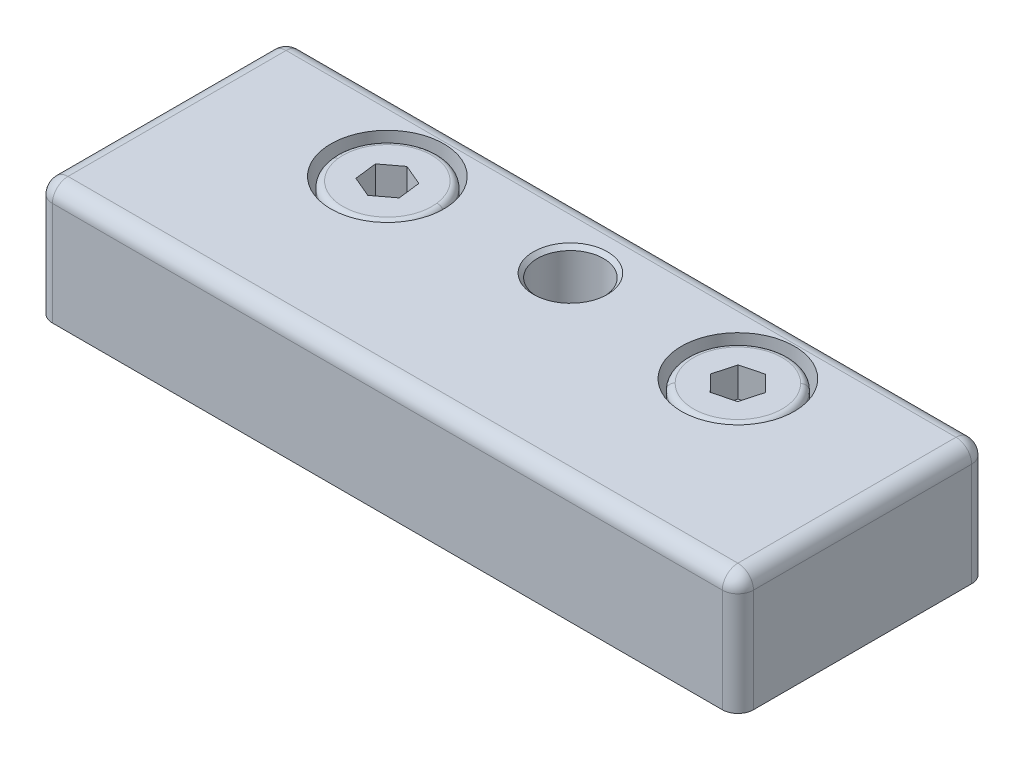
ISO-10303-21;
HEADER;
FILE_DESCRIPTION(('STEP AP214'),'2;1');
FILE_NAME('part.step','',(''),(''),'','','');
FILE_SCHEMA(('AUTOMOTIVE_DESIGN { 1 0 10303 214 1 1 1 1 }'));
ENDSEC;
DATA;
#1=APPLICATION_CONTEXT('core data for automotive mechanical design processes');
#2=APPLICATION_PROTOCOL_DEFINITION('international standard','automotive_design',2000,#1);
#3=PRODUCT_CONTEXT('',#1,'mechanical');
#4=PRODUCT('Part','Part','',(#3));
#5=PRODUCT_RELATED_PRODUCT_CATEGORY('part','',(#4));
#6=PRODUCT_DEFINITION_FORMATION('','',#4);
#7=PRODUCT_DEFINITION_CONTEXT('part definition',#1,'design');
#8=PRODUCT_DEFINITION('design','',#6,#7);
#9=PRODUCT_DEFINITION_SHAPE('','',#8);
#10=(LENGTH_UNIT() NAMED_UNIT(*) SI_UNIT(.MILLI.,.METRE.));
#11=(NAMED_UNIT(*) PLANE_ANGLE_UNIT() SI_UNIT($,.RADIAN.));
#12=(NAMED_UNIT(*) SI_UNIT($,.STERADIAN.) SOLID_ANGLE_UNIT());
#13=UNCERTAINTY_MEASURE_WITH_UNIT(LENGTH_MEASURE(1.E-05),#10,'distance_accuracy_value','');
#14=(GEOMETRIC_REPRESENTATION_CONTEXT(3) GLOBAL_UNCERTAINTY_ASSIGNED_CONTEXT((#13)) GLOBAL_UNIT_ASSIGNED_CONTEXT((#10,
#11,#12)) REPRESENTATION_CONTEXT('',''));
#15=CARTESIAN_POINT('',(0.,0.,0.));
#16=DIRECTION('',(0.,0.,1.));
#17=DIRECTION('',(1.,0.,0.));
#18=AXIS2_PLACEMENT_3D('',#15,#16,#17);
#19=CARTESIAN_POINT('',(-22.6671470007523,4.27567307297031,-7.04068743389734));
#20=DIRECTION('',(0.,1.,0.));
#21=DIRECTION('',(-0.992556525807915,0.,0.121784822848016));
#22=AXIS2_PLACEMENT_3D('',#19,#20,#21);
#23=CONICAL_SURFACE('',#22,2.5,1.0471975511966);
#24=DIRECTION('',(0.859579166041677,0.5,-0.105468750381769));
#25=VECTOR('',#24,1.);
#26=CARTESIAN_POINT('',(-20.1857556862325,4.27567307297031,-7.34514949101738));
#27=LINE('',#26,#25);
#28=CARTESIAN_POINT('',(-22.6671470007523,2.83229739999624,-7.04068743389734));
#29=VERTEX_POINT('',#28);
#30=CARTESIAN_POINT('',(-20.1857556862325,4.27567307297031,-7.34514949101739));
#31=VERTEX_POINT('',#30);
#32=EDGE_CURVE('P0_E333',#29,#31,#27,.T.);
#33=ORIENTED_EDGE('',*,*,#32,.F.);
#34=DIRECTION('',(-0.859579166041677,0.5,0.105468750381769));
#35=VECTOR('',#34,1.);
#36=CARTESIAN_POINT('',(-25.1485383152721,4.27567307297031,-6.7362253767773));
#37=LINE('',#36,#35);
#38=CARTESIAN_POINT('',(-25.1485383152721,4.27567307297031,-6.7362253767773));
#39=VERTEX_POINT('',#38);
#40=EDGE_CURVE('P0_E336',#29,#39,#37,.T.);
#41=ORIENTED_EDGE('',*,*,#40,.T.);
#42=CARTESIAN_POINT('',(-22.6671470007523,4.27567307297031,-7.04068743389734));
#43=DIRECTION('',(0.,1.,0.));
#44=DIRECTION('',(-0.992556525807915,0.,0.121784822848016));
#45=AXIS2_PLACEMENT_3D('',#42,#43,#44);
#46=CIRCLE('',#45,2.5);
#47=CARTESIAN_POINT('',(-23.6441707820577,4.27567307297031,-4.73950849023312));
#48=VERTEX_POINT('',#47);
#49=EDGE_CURVE('P0_E10',#39,#48,#46,.T.);
#50=ORIENTED_EDGE('',*,*,#49,.T.);
#51=CARTESIAN_POINT('',(-22.6671470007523,4.27567307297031,-7.04068743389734));
#52=DIRECTION('',(0.,1.,0.));
#53=DIRECTION('',(-0.992556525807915,0.,0.121784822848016));
#54=AXIS2_PLACEMENT_3D('',#51,#52,#53);
#55=CIRCLE('',#54,2.5);
#56=CARTESIAN_POINT('',(-21.162779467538,4.27567307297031,-5.04397054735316));
#57=VERTEX_POINT('',#56);
#58=EDGE_CURVE('P0_E26',#48,#57,#55,.T.);
#59=ORIENTED_EDGE('',*,*,#58,.T.);
#60=CARTESIAN_POINT('',(-22.6671470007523,4.27567307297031,-7.04068743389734));
#61=DIRECTION('',(0.,1.,0.));
#62=DIRECTION('',(-0.992556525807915,0.,0.121784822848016));
#63=AXIS2_PLACEMENT_3D('',#60,#61,#62);
#64=CIRCLE('',#63,2.5);
#65=EDGE_CURVE('P0_E19',#57,#31,#64,.T.);
#66=ORIENTED_EDGE('',*,*,#65,.T.);
#67=EDGE_LOOP('',(#33,#41,#50,#59,#66));
#68=FACE_BOUND('',#67,.T.);
#69=ADVANCED_FACE('P0_F16',(#68),#23,.F.);
#70=CARTESIAN_POINT('',(-24.9727570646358,4.27567307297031,-5.30359343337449));
#71=DIRECTION('',(0.,1.,0.));
#72=DIRECTION('',(-0.992556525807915,0.,0.121784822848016));
#73=AXIS2_PLACEMENT_3D('',#70,#71,#72);
#74=PLANE('',#73);
#75=ORIENTED_EDGE('',*,*,#49,.F.);
#76=DIRECTION('',(0.121784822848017,0.,0.992556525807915));
#77=VECTOR('',#76,1.);
#78=CARTESIAN_POINT('',(-25.3243195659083,4.27567307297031,-8.16885732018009));
#79=LINE('',#78,#77);
#80=CARTESIAN_POINT('',(-24.9727570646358,4.27567307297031,-5.30359343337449));
#81=VERTEX_POINT('',#80);
#82=EDGE_CURVE('P0_E294',#39,#81,#79,.T.);
#83=ORIENTED_EDGE('',*,*,#82,.T.);
#84=DIRECTION('',(-0.920471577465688,0.,-0.390809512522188));
#85=VECTOR('',#84,1.);
#86=CARTESIAN_POINT('',(-22.3155844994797,4.27567307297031,-4.17542354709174));
#87=LINE('',#86,#85);
#88=EDGE_CURVE('P0_E275',#48,#81,#87,.T.);
#89=ORIENTED_EDGE('',*,*,#88,.F.);
#90=EDGE_LOOP('',(#75,#83,#89));
#91=FACE_BOUND('',#90,.T.);
#92=ADVANCED_FACE('P0_F598',(#91),#74,.T.);
#93=CARTESIAN_POINT('',(-24.9727570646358,4.27567307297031,-5.30359343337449));
#94=DIRECTION('',(0.,1.,0.));
#95=DIRECTION('',(-0.992556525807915,0.,0.121784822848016));
#96=AXIS2_PLACEMENT_3D('',#93,#94,#95);
#97=PLANE('',#96);
#98=ORIENTED_EDGE('',*,*,#58,.F.);
#99=DIRECTION('',(-0.920471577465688,0.,-0.390809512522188));
#100=VECTOR('',#99,1.);
#101=CARTESIAN_POINT('',(-22.3155844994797,4.27567307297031,-4.17542354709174));
#102=LINE('',#101,#100);
#103=CARTESIAN_POINT('',(-22.3155844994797,4.27567307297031,-4.17542354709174));
#104=VERTEX_POINT('',#103);
#105=EDGE_CURVE('P0_E271',#104,#48,#102,.T.);
#106=ORIENTED_EDGE('',*,*,#105,.F.);
#107=DIRECTION('',(0.79868675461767,0.,-0.601747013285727));
#108=VECTOR('',#107,1.);
#109=CARTESIAN_POINT('',(-22.3155844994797,4.27567307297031,-4.17542354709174));
#110=LINE('',#109,#108);
#111=EDGE_CURVE('P0_E207',#104,#57,#110,.T.);
#112=ORIENTED_EDGE('',*,*,#111,.T.);
#113=EDGE_LOOP('',(#98,#106,#112));
#114=FACE_BOUND('',#113,.T.);
#115=ADVANCED_FACE('P0_F599',(#114),#97,.T.);
#116=CARTESIAN_POINT('',(-24.9727570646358,4.27567307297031,-5.30359343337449));
#117=DIRECTION('',(0.,1.,0.));
#118=DIRECTION('',(-0.992556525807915,0.,0.121784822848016));
#119=AXIS2_PLACEMENT_3D('',#116,#117,#118);
#120=PLANE('',#119);
#121=ORIENTED_EDGE('',*,*,#65,.F.);
#122=DIRECTION('',(0.79868675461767,0.,-0.601747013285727));
#123=VECTOR('',#122,1.);
#124=CARTESIAN_POINT('',(-22.3155844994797,4.27567307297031,-4.17542354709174));
#125=LINE('',#124,#123);
#126=CARTESIAN_POINT('',(-20.0099744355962,4.27567307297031,-5.91251754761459));
#127=VERTEX_POINT('',#126);
#128=EDGE_CURVE('P0_E205',#57,#127,#125,.T.);
#129=ORIENTED_EDGE('',*,*,#128,.T.);
#130=DIRECTION('',(-0.121784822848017,0.,-0.992556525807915));
#131=VECTOR('',#130,1.);
#132=CARTESIAN_POINT('',(-20.0099744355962,4.27567307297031,-5.91251754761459));
#133=LINE('',#132,#131);
#134=EDGE_CURVE('P0_E175',#127,#31,#133,.T.);
#135=ORIENTED_EDGE('',*,*,#134,.T.);
#136=EDGE_LOOP('',(#121,#129,#135));
#137=FACE_BOUND('',#136,.T.);
#138=ADVANCED_FACE('P0_F609',(#137),#120,.T.);
#139=CARTESIAN_POINT('',(-24.9727570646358,4.27567307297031,-5.30359343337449));
#140=DIRECTION('',(0.,1.,0.));
#141=DIRECTION('',(-0.992556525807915,0.,0.121784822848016));
#142=AXIS2_PLACEMENT_3D('',#139,#140,#141);
#143=PLANE('',#142);
#144=CARTESIAN_POINT('',(-22.6671470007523,4.27567307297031,-7.04068743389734));
#145=DIRECTION('',(0.,1.,0.));
#146=DIRECTION('',(-0.992556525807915,0.,0.121784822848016));
#147=AXIS2_PLACEMENT_3D('',#144,#145,#146);
#148=CIRCLE('',#147,2.5);
#149=CARTESIAN_POINT('',(-21.6901232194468,4.27567307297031,-9.34186637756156));
#150=VERTEX_POINT('',#149);
#151=EDGE_CURVE('P0_E170',#31,#150,#148,.T.);
#152=ORIENTED_EDGE('',*,*,#151,.F.);
#153=DIRECTION('',(-0.121784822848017,0.,-0.992556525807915));
#154=VECTOR('',#153,1.);
#155=CARTESIAN_POINT('',(-20.0099744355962,4.27567307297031,-5.91251754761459));
#156=LINE('',#155,#154);
#157=CARTESIAN_POINT('',(-20.3615369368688,4.27567307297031,-8.77778143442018));
#158=VERTEX_POINT('',#157);
#159=EDGE_CURVE('P0_E163',#31,#158,#156,.T.);
#160=ORIENTED_EDGE('',*,*,#159,.T.);
#161=DIRECTION('',(0.920471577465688,0.,0.390809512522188));
#162=VECTOR('',#161,1.);
#163=CARTESIAN_POINT('',(-23.0187095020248,4.27567307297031,-9.90595132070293));
#164=LINE('',#163,#162);
#165=EDGE_CURVE('P0_E167',#150,#158,#164,.T.);
#166=ORIENTED_EDGE('',*,*,#165,.F.);
#167=EDGE_LOOP('',(#152,#160,#166));
#168=FACE_BOUND('',#167,.T.);
#169=ADVANCED_FACE('P0_F165',(#168),#143,.T.);
#170=CARTESIAN_POINT('',(-24.9727570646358,4.27567307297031,-5.30359343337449));
#171=DIRECTION('',(0.,1.,0.));
#172=DIRECTION('',(-0.992556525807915,0.,0.121784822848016));
#173=AXIS2_PLACEMENT_3D('',#170,#171,#172);
#174=PLANE('',#173);
#175=CARTESIAN_POINT('',(-22.6671470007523,4.27567307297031,-7.04068743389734));
#176=DIRECTION('',(0.,1.,0.));
#177=DIRECTION('',(-0.992556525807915,0.,0.121784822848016));
#178=AXIS2_PLACEMENT_3D('',#175,#176,#177);
#179=CIRCLE('',#178,2.5);
#180=CARTESIAN_POINT('',(-24.1715145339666,4.27567307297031,-9.03740432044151));
#181=VERTEX_POINT('',#180);
#182=EDGE_CURVE('P0_E317',#150,#181,#179,.T.);
#183=ORIENTED_EDGE('',*,*,#182,.F.);
#184=DIRECTION('',(0.920471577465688,0.,0.390809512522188));
#185=VECTOR('',#184,1.);
#186=CARTESIAN_POINT('',(-23.0187095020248,4.27567307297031,-9.90595132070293));
#187=LINE('',#186,#185);
#188=CARTESIAN_POINT('',(-23.0187095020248,4.27567307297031,-9.90595132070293));
#189=VERTEX_POINT('',#188);
#190=EDGE_CURVE('P0_E189',#189,#150,#187,.T.);
#191=ORIENTED_EDGE('',*,*,#190,.F.);
#192=DIRECTION('',(0.79868675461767,0.,-0.601747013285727));
#193=VECTOR('',#192,1.);
#194=CARTESIAN_POINT('',(-25.3243195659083,4.27567307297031,-8.16885732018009));
#195=LINE('',#194,#193);
#196=EDGE_CURVE('P0_E291',#181,#189,#195,.T.);
#197=ORIENTED_EDGE('',*,*,#196,.F.);
#198=EDGE_LOOP('',(#183,#191,#197));
#199=FACE_BOUND('',#198,.T.);
#200=ADVANCED_FACE('P0_F315',(#199),#174,.T.);
#201=CARTESIAN_POINT('',(-24.9727570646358,4.27567307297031,-5.30359343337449));
#202=DIRECTION('',(0.,1.,0.));
#203=DIRECTION('',(-0.992556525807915,0.,0.121784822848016));
#204=AXIS2_PLACEMENT_3D('',#201,#202,#203);
#205=PLANE('',#204);
#206=CARTESIAN_POINT('',(-22.6671470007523,4.27567307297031,-7.04068743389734));
#207=DIRECTION('',(0.,1.,0.));
#208=DIRECTION('',(-0.992556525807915,0.,0.121784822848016));
#209=AXIS2_PLACEMENT_3D('',#206,#207,#208);
#210=CIRCLE('',#209,2.5);
#211=EDGE_CURVE('P0_E344',#181,#39,#210,.T.);
#212=ORIENTED_EDGE('',*,*,#211,.F.);
#213=DIRECTION('',(0.79868675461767,0.,-0.601747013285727));
#214=VECTOR('',#213,1.);
#215=CARTESIAN_POINT('',(-25.3243195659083,4.27567307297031,-8.16885732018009));
#216=LINE('',#215,#214);
#217=CARTESIAN_POINT('',(-25.3243195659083,4.27567307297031,-8.16885732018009));
#218=VERTEX_POINT('',#217);
#219=EDGE_CURVE('P0_E302',#218,#181,#216,.T.);
#220=ORIENTED_EDGE('',*,*,#219,.F.);
#221=DIRECTION('',(0.121784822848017,0.,0.992556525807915));
#222=VECTOR('',#221,1.);
#223=CARTESIAN_POINT('',(-25.3243195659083,4.27567307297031,-8.16885732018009));
#224=LINE('',#223,#222);
#225=EDGE_CURVE('P0_E297',#218,#39,#224,.T.);
#226=ORIENTED_EDGE('',*,*,#225,.T.);
#227=EDGE_LOOP('',(#212,#220,#226));
#228=FACE_BOUND('',#227,.T.);
#229=ADVANCED_FACE('P0_F590',(#228),#205,.T.);
#230=CARTESIAN_POINT('',(-22.3155844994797,4.27567307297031,-4.17542354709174));
#231=DIRECTION('',(0.601747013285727,0.,0.79868675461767));
#232=DIRECTION('',(0.,1.,0.));
#233=AXIS2_PLACEMENT_3D('',#230,#231,#232);
#234=PLANE('',#233);
#235=DIRECTION('',(0.79868675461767,0.,-0.601747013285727));
#236=VECTOR('',#235,1.);
#237=CARTESIAN_POINT('',(-22.3155844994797,8.07567307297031,-4.17542354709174));
#238=LINE('',#237,#236);
#239=CARTESIAN_POINT('',(-22.3155844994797,8.07567307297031,-4.17542354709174));
#240=VERTEX_POINT('',#239);
#241=CARTESIAN_POINT('',(-20.0099744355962,8.07567307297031,-5.91251754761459));
#242=VERTEX_POINT('',#241);
#243=EDGE_CURVE('P0_E260',#240,#242,#238,.T.);
#244=ORIENTED_EDGE('',*,*,#243,.T.);
#245=DIRECTION('',(0.,1.,0.));
#246=VECTOR('',#245,1.);
#247=CARTESIAN_POINT('',(-20.0099744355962,4.27567307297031,-5.91251754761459));
#248=LINE('',#247,#246);
#249=EDGE_CURVE('P0_E203',#127,#242,#248,.T.);
#250=ORIENTED_EDGE('',*,*,#249,.F.);
#251=ORIENTED_EDGE('',*,*,#128,.F.);
#252=ORIENTED_EDGE('',*,*,#111,.F.);
#253=DIRECTION('',(0.,1.,0.));
#254=VECTOR('',#253,1.);
#255=CARTESIAN_POINT('',(-22.3155844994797,4.27567307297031,-4.17542354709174));
#256=LINE('',#255,#254);
#257=EDGE_CURVE('P0_E276',#104,#240,#256,.T.);
#258=ORIENTED_EDGE('',*,*,#257,.T.);
#259=EDGE_LOOP('',(#244,#250,#251,#252,#258));
#260=FACE_BOUND('',#259,.T.);
#261=ADVANCED_FACE('P0_F606',(#260),#234,.F.);
#262=CARTESIAN_POINT('',(-20.0099744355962,4.27567307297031,-5.91251754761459));
#263=DIRECTION('',(0.992556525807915,0.,-0.121784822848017));
#264=DIRECTION('',(-0.121784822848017,0.,-0.992556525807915));
#265=AXIS2_PLACEMENT_3D('',#262,#263,#264);
#266=PLANE('',#265);
#267=DIRECTION('',(-0.121784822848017,0.,-0.992556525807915));
#268=VECTOR('',#267,1.);
#269=CARTESIAN_POINT('',(-20.0099744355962,8.07567307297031,-5.91251754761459));
#270=LINE('',#269,#268);
#271=CARTESIAN_POINT('',(-20.3615369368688,8.07567307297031,-8.77778143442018));
#272=VERTEX_POINT('',#271);
#273=EDGE_CURVE('P0_E181',#242,#272,#270,.T.);
#274=ORIENTED_EDGE('',*,*,#273,.T.);
#275=DIRECTION('',(0.,1.,0.));
#276=VECTOR('',#275,1.);
#277=CARTESIAN_POINT('',(-20.3615369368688,4.27567307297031,-8.77778143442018));
#278=LINE('',#277,#276);
#279=EDGE_CURVE('P0_E176',#158,#272,#278,.T.);
#280=ORIENTED_EDGE('',*,*,#279,.F.);
#281=ORIENTED_EDGE('',*,*,#159,.F.);
#282=ORIENTED_EDGE('',*,*,#134,.F.);
#283=ORIENTED_EDGE('',*,*,#249,.T.);
#284=EDGE_LOOP('',(#274,#280,#281,#282,#283));
#285=FACE_BOUND('',#284,.T.);
#286=ADVANCED_FACE('P0_F179',(#285),#266,.F.);
#287=CARTESIAN_POINT('',(-23.0187095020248,4.27567307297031,-9.90595132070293));
#288=DIRECTION('',(-0.390809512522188,0.,0.920471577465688));
#289=DIRECTION('',(0.,-1.,0.));
#290=AXIS2_PLACEMENT_3D('',#287,#288,#289);
#291=PLANE('',#290);
#292=DIRECTION('',(0.920471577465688,0.,0.390809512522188));
#293=VECTOR('',#292,1.);
#294=CARTESIAN_POINT('',(-23.0187095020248,8.07567307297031,-9.90595132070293));
#295=LINE('',#294,#293);
#296=CARTESIAN_POINT('',(-23.0187095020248,8.07567307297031,-9.90595132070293));
#297=VERTEX_POINT('',#296);
#298=EDGE_CURVE('P0_E254',#297,#272,#295,.T.);
#299=ORIENTED_EDGE('',*,*,#298,.F.);
#300=DIRECTION('',(0.,1.,0.));
#301=VECTOR('',#300,1.);
#302=CARTESIAN_POINT('',(-23.0187095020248,4.27567307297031,-9.90595132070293));
#303=LINE('',#302,#301);
#304=EDGE_CURVE('P0_E197',#189,#297,#303,.T.);
#305=ORIENTED_EDGE('',*,*,#304,.F.);
#306=ORIENTED_EDGE('',*,*,#190,.T.);
#307=ORIENTED_EDGE('',*,*,#165,.T.);
#308=ORIENTED_EDGE('',*,*,#279,.T.);
#309=EDGE_LOOP('',(#299,#305,#306,#307,#308));
#310=FACE_BOUND('',#309,.T.);
#311=ADVANCED_FACE('P0_F187',(#310),#291,.T.);
#312=CARTESIAN_POINT('',(-25.3243195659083,4.27567307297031,-8.16885732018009));
#313=DIRECTION('',(0.601747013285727,0.,0.79868675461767));
#314=DIRECTION('',(0.,1.,0.));
#315=AXIS2_PLACEMENT_3D('',#312,#313,#314);
#316=PLANE('',#315);
#317=DIRECTION('',(0.79868675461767,0.,-0.601747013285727));
#318=VECTOR('',#317,1.);
#319=CARTESIAN_POINT('',(-25.3243195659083,8.07567307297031,-8.16885732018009));
#320=LINE('',#319,#318);
#321=CARTESIAN_POINT('',(-25.3243195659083,8.07567307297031,-8.16885732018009));
#322=VERTEX_POINT('',#321);
#323=EDGE_CURVE('P0_E257',#322,#297,#320,.T.);
#324=ORIENTED_EDGE('',*,*,#323,.F.);
#325=DIRECTION('',(0.,1.,0.));
#326=VECTOR('',#325,1.);
#327=CARTESIAN_POINT('',(-25.3243195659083,4.27567307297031,-8.16885732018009));
#328=LINE('',#327,#326);
#329=EDGE_CURVE('P0_E301',#218,#322,#328,.T.);
#330=ORIENTED_EDGE('',*,*,#329,.F.);
#331=ORIENTED_EDGE('',*,*,#219,.T.);
#332=ORIENTED_EDGE('',*,*,#196,.T.);
#333=ORIENTED_EDGE('',*,*,#304,.T.);
#334=EDGE_LOOP('',(#324,#330,#331,#332,#333));
#335=FACE_BOUND('',#334,.T.);
#336=ADVANCED_FACE('P0_F311',(#335),#316,.T.);
#337=CARTESIAN_POINT('',(-25.3243195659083,4.27567307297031,-8.16885732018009));
#338=DIRECTION('',(-0.992556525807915,0.,0.121784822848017));
#339=DIRECTION('',(-0.121784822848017,0.,-0.992556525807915));
#340=AXIS2_PLACEMENT_3D('',#337,#338,#339);
#341=PLANE('',#340);
#342=DIRECTION('',(0.121784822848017,0.,0.992556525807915));
#343=VECTOR('',#342,1.);
#344=CARTESIAN_POINT('',(-25.3243195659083,8.07567307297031,-8.16885732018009));
#345=LINE('',#344,#343);
#346=CARTESIAN_POINT('',(-24.9727570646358,8.07567307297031,-5.30359343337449));
#347=VERTEX_POINT('',#346);
#348=EDGE_CURVE('P0_E251',#322,#347,#345,.T.);
#349=ORIENTED_EDGE('',*,*,#348,.T.);
#350=DIRECTION('',(0.,1.,0.));
#351=VECTOR('',#350,1.);
#352=CARTESIAN_POINT('',(-24.9727570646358,4.27567307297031,-5.30359343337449));
#353=LINE('',#352,#351);
#354=EDGE_CURVE('P0_E288',#81,#347,#353,.T.);
#355=ORIENTED_EDGE('',*,*,#354,.F.);
#356=ORIENTED_EDGE('',*,*,#82,.F.);
#357=ORIENTED_EDGE('',*,*,#225,.F.);
#358=ORIENTED_EDGE('',*,*,#329,.T.);
#359=EDGE_LOOP('',(#349,#355,#356,#357,#358));
#360=FACE_BOUND('',#359,.T.);
#361=ADVANCED_FACE('P0_F595',(#360),#341,.F.);
#362=CARTESIAN_POINT('',(-22.3155844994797,4.27567307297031,-4.17542354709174));
#363=DIRECTION('',(0.390809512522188,0.,-0.920471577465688));
#364=DIRECTION('',(0.920471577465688,0.,0.390809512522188));
#365=AXIS2_PLACEMENT_3D('',#362,#363,#364);
#366=PLANE('',#365);
#367=DIRECTION('',(-0.920471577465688,0.,-0.390809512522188));
#368=VECTOR('',#367,1.);
#369=CARTESIAN_POINT('',(-22.3155844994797,8.07567307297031,-4.17542354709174));
#370=LINE('',#369,#368);
#371=EDGE_CURVE('P0_E247',#240,#347,#370,.T.);
#372=ORIENTED_EDGE('',*,*,#371,.F.);
#373=ORIENTED_EDGE('',*,*,#257,.F.);
#374=ORIENTED_EDGE('',*,*,#105,.T.);
#375=ORIENTED_EDGE('',*,*,#88,.T.);
#376=ORIENTED_EDGE('',*,*,#354,.T.);
#377=EDGE_LOOP('',(#372,#373,#374,#375,#376));
#378=FACE_BOUND('',#377,.T.);
#379=ADVANCED_FACE('P0_F603',(#378),#366,.T.);
#380=CARTESIAN_POINT('',(-22.6671470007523,7.27567307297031,-7.04068743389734));
#381=DIRECTION('',(0.,1.,0.));
#382=DIRECTION('',(-0.992556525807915,0.,0.121784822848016));
#383=AXIS2_PLACEMENT_3D('',#380,#381,#382);
#384=TOROIDAL_SURFACE('',#383,5.7,0.8);
#385=CARTESIAN_POINT('',(-17.0095748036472,7.27567307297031,-7.73486092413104));
#386=DIRECTION('',(0.121784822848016,0.,0.992556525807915));
#387=DIRECTION('',(-0.992556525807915,0.,0.121784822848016));
#388=AXIS2_PLACEMENT_3D('',#385,#386,#387);
#389=CIRCLE('',#388,0.8);
#390=CARTESIAN_POINT('',(-16.2155295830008,7.27567307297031,-7.83228878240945));
#391=VERTEX_POINT('',#390);
#392=CARTESIAN_POINT('',(-17.0095748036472,8.07567307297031,-7.73486092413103));
#393=VERTEX_POINT('',#392);
#394=EDGE_CURVE('P0_E343',#391,#393,#389,.T.);
#395=ORIENTED_EDGE('',*,*,#394,.F.);
#396=CARTESIAN_POINT('',(-22.6671470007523,7.27567307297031,-7.04068743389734));
#397=DIRECTION('',(0.,-1.,0.));
#398=DIRECTION('',(-0.992556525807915,0.,0.121784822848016));
#399=AXIS2_PLACEMENT_3D('',#396,#397,#398);
#400=CIRCLE('',#399,6.5);
#401=CARTESIAN_POINT('',(-29.1187644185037,7.27567307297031,-6.24908608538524));
#402=VERTEX_POINT('',#401);
#403=EDGE_CURVE('P0_E267',#402,#391,#400,.T.);
#404=ORIENTED_EDGE('',*,*,#403,.F.);
#405=CARTESIAN_POINT('',(-28.3247191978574,7.27567307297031,-6.34651394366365));
#406=DIRECTION('',(-0.121784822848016,0.,-0.992556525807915));
#407=DIRECTION('',(0.992556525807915,0.,-0.121784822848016));
#408=AXIS2_PLACEMENT_3D('',#405,#406,#407);
#409=CIRCLE('',#408,0.8);
#410=CARTESIAN_POINT('',(-28.3247191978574,8.07567307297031,-6.34651394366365));
#411=VERTEX_POINT('',#410);
#412=EDGE_CURVE('P0_E362',#402,#411,#409,.T.);
#413=ORIENTED_EDGE('',*,*,#412,.T.);
#414=CARTESIAN_POINT('',(-22.6671470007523,8.07567307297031,-7.04068743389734));
#415=DIRECTION('',(0.,1.,0.));
#416=DIRECTION('',(-0.992556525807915,0.,0.121784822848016));
#417=AXIS2_PLACEMENT_3D('',#414,#415,#416);
#418=CIRCLE('',#417,5.7);
#419=EDGE_CURVE('P0_E244',#393,#411,#418,.T.);
#420=ORIENTED_EDGE('',*,*,#419,.F.);
#421=EDGE_LOOP('',(#395,#404,#413,#420));
#422=FACE_BOUND('',#421,.T.);
#423=ADVANCED_FACE('P0_F640',(#422),#384,.T.);
#424=CARTESIAN_POINT('',(-22.6671470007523,2.67567307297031,-7.04068743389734));
#425=DIRECTION('',(0.,-1.,0.));
#426=DIRECTION('',(0.992556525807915,0.,-0.121784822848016));
#427=AXIS2_PLACEMENT_3D('',#424,#425,#426);
#428=TOROIDAL_SURFACE('',#427,4.39999999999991,0.4);
#429=CARTESIAN_POINT('',(-27.034395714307,2.67567307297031,-6.50483421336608));
#430=DIRECTION('',(0.121784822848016,0.,0.992556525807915));
#431=DIRECTION('',(-0.992556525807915,0.,0.121784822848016));
#432=AXIS2_PLACEMENT_3D('',#429,#430,#431);
#433=CIRCLE('',#432,0.4);
#434=CARTESIAN_POINT('',(-26.6373731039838,2.67567307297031,-6.55354814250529));
#435=VERTEX_POINT('',#434);
#436=CARTESIAN_POINT('',(-27.034395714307,3.07567307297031,-6.50483421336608));
#437=VERTEX_POINT('',#436);
#438=EDGE_CURVE('P0_E372',#435,#437,#433,.T.);
#439=ORIENTED_EDGE('',*,*,#438,.F.);
#440=CARTESIAN_POINT('',(-22.6671470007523,2.67567307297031,-7.04068743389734));
#441=DIRECTION('',(0.,-1.,0.));
#442=DIRECTION('',(0.992556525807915,0.,-0.121784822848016));
#443=AXIS2_PLACEMENT_3D('',#440,#441,#442);
#444=CIRCLE('',#443,3.99999999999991);
#445=CARTESIAN_POINT('',(-18.6969208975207,2.67567307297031,-7.5278267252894));
#446=VERTEX_POINT('',#445);
#447=EDGE_CURVE('P0_E227',#446,#435,#444,.T.);
#448=ORIENTED_EDGE('',*,*,#447,.F.);
#449=CARTESIAN_POINT('',(-18.2998982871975,2.67567307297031,-7.5765406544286));
#450=DIRECTION('',(-0.121784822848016,0.,-0.992556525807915));
#451=DIRECTION('',(0.992556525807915,0.,-0.121784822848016));
#452=AXIS2_PLACEMENT_3D('',#449,#450,#451);
#453=CIRCLE('',#452,0.4);
#454=CARTESIAN_POINT('',(-18.2998982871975,3.07567307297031,-7.5765406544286));
#455=VERTEX_POINT('',#454);
#456=EDGE_CURVE('P0_E354',#446,#455,#453,.T.);
#457=ORIENTED_EDGE('',*,*,#456,.T.);
#458=CARTESIAN_POINT('',(-22.6671470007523,3.07567307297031,-7.04068743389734));
#459=DIRECTION('',(0.,1.,0.));
#460=DIRECTION('',(0.992556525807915,0.,-0.121784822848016));
#461=AXIS2_PLACEMENT_3D('',#458,#459,#460);
#462=CIRCLE('',#461,4.39999999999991);
#463=EDGE_CURVE('P0_E270',#437,#455,#462,.T.);
#464=ORIENTED_EDGE('',*,*,#463,.F.);
#465=EDGE_LOOP('',(#439,#448,#457,#464));
#466=FACE_BOUND('',#465,.T.);
#467=ADVANCED_FACE('P0_F643',(#466),#428,.F.);
#468=CARTESIAN_POINT('',(-22.2641001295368,-21.9243269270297,-3.75582161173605));
#469=DIRECTION('',(0.,-1.,0.));
#470=DIRECTION('',(0.121784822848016,0.,0.992556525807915));
#471=AXIS2_PLACEMENT_3D('',#468,#469,#470);
#472=PLANE('',#471);
#473=CARTESIAN_POINT('',(-22.6671470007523,-21.9243269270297,-7.04068743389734));
#474=DIRECTION('',(0.,1.,0.));
#475=DIRECTION('',(-0.992556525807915,0.,0.121784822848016));
#476=AXIS2_PLACEMENT_3D('',#473,#474,#475);
#477=CIRCLE('',#476,3.3095);
#478=CARTESIAN_POINT('',(-25.9520128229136,-21.9243269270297,-6.63764056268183));
#479=VERTEX_POINT('',#478);
#480=CARTESIAN_POINT('',(-19.382281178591,-21.9243269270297,-7.44373430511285));
#481=VERTEX_POINT('',#480);
#482=EDGE_CURVE('P0_E350',#479,#481,#477,.T.);
#483=ORIENTED_EDGE('',*,*,#482,.F.);
#484=CARTESIAN_POINT('',(-22.6671470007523,-21.9243269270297,-7.04068743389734));
#485=DIRECTION('',(0.,1.,0.));
#486=DIRECTION('',(-0.992556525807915,0.,0.121784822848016));
#487=AXIS2_PLACEMENT_3D('',#484,#485,#486);
#488=CIRCLE('',#487,3.3095);
#489=EDGE_CURVE('P0_E280',#481,#479,#488,.T.);
#490=ORIENTED_EDGE('',*,*,#489,.F.);
#491=EDGE_LOOP('',(#483,#490));
#492=FACE_BOUND('',#491,.T.);
#493=ADVANCED_FACE('P0_F649',(#492),#472,.T.);
#494=CARTESIAN_POINT('',(-22.6671470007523,-21.9243269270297,-7.04068743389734));
#495=DIRECTION('',(0.,1.,0.));
#496=DIRECTION('',(-0.992556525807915,0.,0.121784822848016));
#497=AXIS2_PLACEMENT_3D('',#494,#495,#496);
#498=CONICAL_SURFACE('',#497,3.3095,0.785398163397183);
#499=DIRECTION('',(0.701843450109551,0.707106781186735,-0.0861148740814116));
#500=VECTOR('',#499,1.);
#501=CARTESIAN_POINT('',(-19.382281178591,-21.9243269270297,-7.44373430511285));
#502=LINE('',#501,#500);
#503=CARTESIAN_POINT('',(-18.6969208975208,-21.2338269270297,-7.52782672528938));
#504=VERTEX_POINT('',#503);
#505=EDGE_CURVE('P0_E345',#481,#504,#502,.T.);
#506=ORIENTED_EDGE('',*,*,#505,.F.);
#507=ORIENTED_EDGE('',*,*,#489,.T.);
#508=DIRECTION('',(-0.701843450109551,0.707106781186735,0.0861148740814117));
#509=VECTOR('',#508,1.);
#510=CARTESIAN_POINT('',(-25.9520128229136,-21.9243269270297,-6.63764056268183));
#511=LINE('',#510,#509);
#512=CARTESIAN_POINT('',(-26.6373731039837,-21.2338269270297,-6.5535481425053));
#513=VERTEX_POINT('',#512);
#514=EDGE_CURVE('P0_E384',#479,#513,#511,.T.);
#515=ORIENTED_EDGE('',*,*,#514,.T.);
#516=CARTESIAN_POINT('',(-22.6671470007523,-21.2338269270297,-7.04068743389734));
#517=DIRECTION('',(0.,1.,0.));
#518=DIRECTION('',(-0.992556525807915,0.,0.121784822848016));
#519=AXIS2_PLACEMENT_3D('',#516,#517,#518);
#520=CIRCLE('',#519,3.99999999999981);
#521=EDGE_CURVE('P0_E277',#504,#513,#520,.T.);
#522=ORIENTED_EDGE('',*,*,#521,.F.);
#523=EDGE_LOOP('',(#506,#507,#515,#522));
#524=FACE_BOUND('',#523,.T.);
#525=ADVANCED_FACE('P0_F653',(#524),#498,.T.);
#526=CARTESIAN_POINT('',(-22.6671470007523,39.8256730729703,-7.04068743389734));
#527=DIRECTION('',(0.,1.,0.));
#528=DIRECTION('',(-0.992556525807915,0.,0.121784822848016));
#529=AXIS2_PLACEMENT_3D('',#526,#527,#528);
#530=CYLINDRICAL_SURFACE('',#529,3.99999999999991);
#531=DIRECTION('',(0.,1.,0.));
#532=VECTOR('',#531,1.);
#533=CARTESIAN_POINT('',(-18.6969208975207,39.8256730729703,-7.5278267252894));
#534=LINE('',#533,#532);
#535=EDGE_CURVE('P0_E225',#504,#446,#534,.T.);
#536=ORIENTED_EDGE('',*,*,#535,.F.);
#537=ORIENTED_EDGE('',*,*,#521,.T.);
#538=DIRECTION('',(0.,1.,0.));
#539=VECTOR('',#538,1.);
#540=CARTESIAN_POINT('',(-26.6373731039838,39.8256730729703,-6.55354814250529));
#541=LINE('',#540,#539);
#542=EDGE_CURVE('P0_E231',#513,#435,#541,.T.);
#543=ORIENTED_EDGE('',*,*,#542,.T.);
#544=CARTESIAN_POINT('',(-22.6671470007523,2.67567307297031,-7.04068743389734));
#545=DIRECTION('',(0.,-1.,0.));
#546=DIRECTION('',(0.992556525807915,0.,-0.121784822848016));
#547=AXIS2_PLACEMENT_3D('',#544,#545,#546);
#548=CIRCLE('',#547,3.99999999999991);
#549=EDGE_CURVE('P0_E366',#435,#446,#548,.T.);
#550=ORIENTED_EDGE('',*,*,#549,.T.);
#551=EDGE_LOOP('',(#536,#537,#543,#550));
#552=FACE_BOUND('',#551,.T.);
#553=ADVANCED_FACE('P0_F414',(#552),#530,.T.);
#554=CARTESIAN_POINT('',(-21.8755456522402,3.07567307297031,-0.589070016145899));
#555=DIRECTION('',(0.,-1.,0.));
#556=DIRECTION('',(0.121784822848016,0.,0.992556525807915));
#557=AXIS2_PLACEMENT_3D('',#554,#555,#556);
#558=PLANE('',#557);
#559=CARTESIAN_POINT('',(-22.6671470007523,3.07567307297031,-7.04068743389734));
#560=DIRECTION('',(0.,1.,0.));
#561=DIRECTION('',(0.992556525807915,0.,-0.121784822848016));
#562=AXIS2_PLACEMENT_3D('',#559,#560,#561);
#563=CIRCLE('',#562,4.39999999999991);
#564=EDGE_CURVE('P0_E376',#455,#437,#563,.T.);
#565=ORIENTED_EDGE('',*,*,#564,.T.);
#566=ORIENTED_EDGE('',*,*,#463,.T.);
#567=EDGE_LOOP('',(#565,#566));
#568=FACE_BOUND('',#567,.T.);
#569=CARTESIAN_POINT('',(-22.6671470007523,3.07567307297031,-7.04068743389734));
#570=DIRECTION('',(0.,1.,0.));
#571=DIRECTION('',(-0.992556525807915,0.,0.121784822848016));
#572=AXIS2_PLACEMENT_3D('',#569,#570,#571);
#573=CIRCLE('',#572,6.5);
#574=CARTESIAN_POINT('',(-29.1187644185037,3.07567307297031,-6.24908608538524));
#575=VERTEX_POINT('',#574);
#576=CARTESIAN_POINT('',(-16.2155295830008,3.07567307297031,-7.83228878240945));
#577=VERTEX_POINT('',#576);
#578=EDGE_CURVE('P0_E235',#575,#577,#573,.T.);
#579=ORIENTED_EDGE('',*,*,#578,.F.);
#580=CARTESIAN_POINT('',(-22.6671470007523,3.07567307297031,-7.04068743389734));
#581=DIRECTION('',(0.,1.,0.));
#582=DIRECTION('',(-0.992556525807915,0.,0.121784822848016));
#583=AXIS2_PLACEMENT_3D('',#580,#581,#582);
#584=CIRCLE('',#583,6.5);
#585=EDGE_CURVE('P0_E264',#577,#575,#584,.T.);
#586=ORIENTED_EDGE('',*,*,#585,.F.);
#587=EDGE_LOOP('',(#579,#586));
#588=FACE_BOUND('',#587,.T.);
#589=ADVANCED_FACE('P0_F659',(#568,#588),#558,.T.);
#590=CARTESIAN_POINT('',(-22.6671470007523,39.8256730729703,-7.04068743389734));
#591=DIRECTION('',(0.,1.,0.));
#592=DIRECTION('',(-0.992556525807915,0.,0.121784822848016));
#593=AXIS2_PLACEMENT_3D('',#590,#591,#592);
#594=CYLINDRICAL_SURFACE('',#593,6.5);
#595=DIRECTION('',(0.,1.,0.));
#596=VECTOR('',#595,1.);
#597=CARTESIAN_POINT('',(-16.2155295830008,39.8256730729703,-7.83228878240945));
#598=LINE('',#597,#596);
#599=EDGE_CURVE('P0_E236',#577,#391,#598,.T.);
#600=ORIENTED_EDGE('',*,*,#599,.F.);
#601=ORIENTED_EDGE('',*,*,#585,.T.);
#602=DIRECTION('',(0.,1.,0.));
#603=VECTOR('',#602,1.);
#604=CARTESIAN_POINT('',(-29.1187644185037,39.8256730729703,-6.24908608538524));
#605=LINE('',#604,#603);
#606=EDGE_CURVE('P0_E240',#575,#402,#605,.T.);
#607=ORIENTED_EDGE('',*,*,#606,.T.);
#608=ORIENTED_EDGE('',*,*,#403,.T.);
#609=EDGE_LOOP('',(#600,#601,#607,#608));
#610=FACE_BOUND('',#609,.T.);
#611=ADVANCED_FACE('P0_F662',(#610),#594,.T.);
#612=CARTESIAN_POINT('',(-22.6671470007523,8.07567307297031,-7.04068743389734));
#613=DIRECTION('',(0.,1.,0.));
#614=DIRECTION('',(-0.992556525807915,0.,0.121784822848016));
#615=AXIS2_PLACEMENT_3D('',#612,#613,#614);
#616=PLANE('',#615);
#617=ORIENTED_EDGE('',*,*,#371,.T.);
#618=ORIENTED_EDGE('',*,*,#348,.F.);
#619=ORIENTED_EDGE('',*,*,#323,.T.);
#620=ORIENTED_EDGE('',*,*,#298,.T.);
#621=ORIENTED_EDGE('',*,*,#273,.F.);
#622=ORIENTED_EDGE('',*,*,#243,.F.);
#623=EDGE_LOOP('',(#617,#618,#619,#620,#621,#622));
#624=FACE_BOUND('',#623,.T.);
#625=CARTESIAN_POINT('',(-22.6671470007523,8.07567307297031,-7.04068743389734));
#626=DIRECTION('',(0.,1.,0.));
#627=DIRECTION('',(-0.992556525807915,0.,0.121784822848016));
#628=AXIS2_PLACEMENT_3D('',#625,#626,#627);
#629=CIRCLE('',#628,5.7);
#630=EDGE_CURVE('P0_E358',#411,#393,#629,.T.);
#631=ORIENTED_EDGE('',*,*,#630,.T.);
#632=ORIENTED_EDGE('',*,*,#419,.T.);
#633=EDGE_LOOP('',(#631,#632));
#634=FACE_BOUND('',#633,.T.);
#635=ADVANCED_FACE('P0_F321',(#624,#634),#616,.T.);
#636=CARTESIAN_POINT('',(-22.6671470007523,39.8256730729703,-7.04068743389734));
#637=DIRECTION('',(0.,1.,0.));
#638=DIRECTION('',(-0.992556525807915,0.,0.121784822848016));
#639=AXIS2_PLACEMENT_3D('',#636,#637,#638);
#640=CYLINDRICAL_SURFACE('',#639,6.5);
#641=ORIENTED_EDGE('',*,*,#578,.T.);
#642=ORIENTED_EDGE('',*,*,#599,.T.);
#643=CARTESIAN_POINT('',(-22.6671470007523,7.27567307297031,-7.04068743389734));
#644=DIRECTION('',(0.,-1.,0.));
#645=DIRECTION('',(-0.992556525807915,0.,0.121784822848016));
#646=AXIS2_PLACEMENT_3D('',#643,#644,#645);
#647=CIRCLE('',#646,6.5);
#648=EDGE_CURVE('P0_E339',#391,#402,#647,.T.);
#649=ORIENTED_EDGE('',*,*,#648,.T.);
#650=ORIENTED_EDGE('',*,*,#606,.F.);
#651=EDGE_LOOP('',(#641,#642,#649,#650));
#652=FACE_BOUND('',#651,.T.);
#653=ADVANCED_FACE('P0_F669',(#652),#640,.T.);
#654=CARTESIAN_POINT('',(-22.6671470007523,39.8256730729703,-7.04068743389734));
#655=DIRECTION('',(0.,1.,0.));
#656=DIRECTION('',(-0.992556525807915,0.,0.121784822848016));
#657=AXIS2_PLACEMENT_3D('',#654,#655,#656);
#658=CYLINDRICAL_SURFACE('',#657,3.99999999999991);
#659=CARTESIAN_POINT('',(-22.6671470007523,-21.2338269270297,-7.04068743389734));
#660=DIRECTION('',(0.,1.,0.));
#661=DIRECTION('',(-0.992556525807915,0.,0.121784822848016));
#662=AXIS2_PLACEMENT_3D('',#659,#660,#661);
#663=CIRCLE('',#662,3.99999999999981);
#664=EDGE_CURVE('P0_E349',#513,#504,#663,.T.);
#665=ORIENTED_EDGE('',*,*,#664,.T.);
#666=ORIENTED_EDGE('',*,*,#535,.T.);
#667=ORIENTED_EDGE('',*,*,#447,.T.);
#668=ORIENTED_EDGE('',*,*,#542,.F.);
#669=EDGE_LOOP('',(#665,#666,#667,#668));
#670=FACE_BOUND('',#669,.T.);
#671=ADVANCED_FACE('P0_F673',(#670),#658,.T.);
#672=CARTESIAN_POINT('',(-22.6671470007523,-21.9243269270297,-7.04068743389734));
#673=DIRECTION('',(0.,1.,0.));
#674=DIRECTION('',(-0.992556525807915,0.,0.121784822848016));
#675=AXIS2_PLACEMENT_3D('',#672,#673,#674);
#676=CONICAL_SURFACE('',#675,3.3095,0.785398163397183);
#677=ORIENTED_EDGE('',*,*,#482,.T.);
#678=ORIENTED_EDGE('',*,*,#505,.T.);
#679=ORIENTED_EDGE('',*,*,#664,.F.);
#680=ORIENTED_EDGE('',*,*,#514,.F.);
#681=EDGE_LOOP('',(#677,#678,#679,#680));
#682=FACE_BOUND('',#681,.T.);
#683=ADVANCED_FACE('P0_F670',(#682),#676,.T.);
#684=CARTESIAN_POINT('',(-22.6671470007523,2.67567307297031,-7.04068743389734));
#685=DIRECTION('',(0.,-1.,0.));
#686=DIRECTION('',(0.992556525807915,0.,-0.121784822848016));
#687=AXIS2_PLACEMENT_3D('',#684,#685,#686);
#688=TOROIDAL_SURFACE('',#687,4.39999999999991,0.4);
#689=ORIENTED_EDGE('',*,*,#549,.F.);
#690=ORIENTED_EDGE('',*,*,#438,.T.);
#691=ORIENTED_EDGE('',*,*,#564,.F.);
#692=ORIENTED_EDGE('',*,*,#456,.F.);
#693=EDGE_LOOP('',(#689,#690,#691,#692));
#694=FACE_BOUND('',#693,.T.);
#695=ADVANCED_FACE('P0_F417',(#694),#688,.F.);
#696=CARTESIAN_POINT('',(-22.6671470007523,7.27567307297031,-7.04068743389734));
#697=DIRECTION('',(0.,1.,0.));
#698=DIRECTION('',(-0.992556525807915,0.,0.121784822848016));
#699=AXIS2_PLACEMENT_3D('',#696,#697,#698);
#700=TOROIDAL_SURFACE('',#699,5.7,0.8);
#701=ORIENTED_EDGE('',*,*,#648,.F.);
#702=ORIENTED_EDGE('',*,*,#394,.T.);
#703=ORIENTED_EDGE('',*,*,#630,.F.);
#704=ORIENTED_EDGE('',*,*,#412,.F.);
#705=EDGE_LOOP('',(#701,#702,#703,#704));
#706=FACE_BOUND('',#705,.T.);
#707=ADVANCED_FACE('P0_F680',(#706),#700,.T.);
#708=CARTESIAN_POINT('',(-22.6671470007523,4.27567307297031,-7.04068743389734));
#709=DIRECTION('',(0.,1.,0.));
#710=DIRECTION('',(-0.992556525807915,0.,0.121784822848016));
#711=AXIS2_PLACEMENT_3D('',#708,#709,#710);
#712=CONICAL_SURFACE('',#711,2.5,1.0471975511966);
#713=ORIENTED_EDGE('',*,*,#40,.F.);
#714=ORIENTED_EDGE('',*,*,#32,.T.);
#715=ORIENTED_EDGE('',*,*,#151,.T.);
#716=ORIENTED_EDGE('',*,*,#182,.T.);
#717=ORIENTED_EDGE('',*,*,#211,.T.);
#718=EDGE_LOOP('',(#713,#714,#715,#716,#717));
#719=FACE_BOUND('',#718,.T.);
#720=ADVANCED_FACE('P0_F588',(#719),#712,.F.);
#721=CLOSED_SHELL('',(#69,#92,#115,#138,#169,#200,#229,#261,#286,#311,#336,#361,#379,#423,#467,
#493,#525,#553,#589,#611,#635,#653,#671,#683,#695,#707,#720));
#722=MANIFOLD_SOLID_BREP('P0_B1',#721);
#723=CARTESIAN_POINT('',(22.3328529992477,4.27567307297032,-7.04068743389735));
#724=DIRECTION('',(0.,1.,0.));
#725=DIRECTION('',(-0.713176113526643,0.,0.700984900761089));
#726=AXIS2_PLACEMENT_3D('',#723,#724,#725);
#727=CONICAL_SURFACE('',#726,2.5,1.0471975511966);
#728=DIRECTION('',(0.617628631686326,0.5,-0.607070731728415));
#729=VECTOR('',#728,1.);
#730=CARTESIAN_POINT('',(24.1157932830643,4.27567307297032,-8.79314968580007));
#731=LINE('',#730,#729);
#732=CARTESIAN_POINT('',(22.3328529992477,2.83229739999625,-7.04068743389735));
#733=VERTEX_POINT('',#732);
#734=CARTESIAN_POINT('',(24.1157932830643,4.27567307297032,-8.79314968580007));
#735=VERTEX_POINT('',#734);
#736=EDGE_CURVE('P1_E334',#733,#735,#731,.T.);
#737=ORIENTED_EDGE('',*,*,#736,.F.);
#738=DIRECTION('',(-0.617628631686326,0.5,0.607070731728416));
#739=VECTOR('',#738,1.);
#740=CARTESIAN_POINT('',(20.5499127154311,4.27567307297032,-5.28822518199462));
#741=LINE('',#740,#739);
#742=CARTESIAN_POINT('',(20.5499127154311,4.27567307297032,-5.28822518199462));
#743=VERTEX_POINT('',#742);
#744=EDGE_CURVE('P1_E337',#733,#743,#741,.T.);
#745=ORIENTED_EDGE('',*,*,#744,.T.);
#746=CARTESIAN_POINT('',(22.3328529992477,4.27567307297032,-7.04068743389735));
#747=DIRECTION('',(0.,1.,0.));
#748=DIRECTION('',(-0.713176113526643,0.,0.700984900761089));
#749=AXIS2_PLACEMENT_3D('',#746,#747,#748);
#750=CIRCLE('',#749,2.5);
#751=CARTESIAN_POINT('',(22.9590596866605,4.27567307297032,-4.62038472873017));
#752=VERTEX_POINT('',#751);
#753=EDGE_CURVE('P1_E11',#743,#752,#750,.T.);
#754=ORIENTED_EDGE('',*,*,#753,.T.);
#755=CARTESIAN_POINT('',(22.3328529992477,4.27567307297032,-7.04068743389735));
#756=DIRECTION('',(0.,1.,0.));
#757=DIRECTION('',(-0.713176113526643,0.,0.700984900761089));
#758=AXIS2_PLACEMENT_3D('',#755,#756,#757);
#759=CIRCLE('',#758,2.5);
#760=CARTESIAN_POINT('',(24.7419999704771,4.27567307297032,-6.37284698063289));
#761=VERTEX_POINT('',#760);
#762=EDGE_CURVE('P1_E27',#752,#761,#759,.T.);
#763=ORIENTED_EDGE('',*,*,#762,.T.);
#764=CARTESIAN_POINT('',(22.3328529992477,4.27567307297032,-7.04068743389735));
#765=DIRECTION('',(0.,1.,0.));
#766=DIRECTION('',(-0.713176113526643,0.,0.700984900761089));
#767=AXIS2_PLACEMENT_3D('',#764,#765,#766);
#768=CIRCLE('',#767,2.5);
#769=EDGE_CURVE('P1_E20',#761,#735,#768,.T.);
#770=ORIENTED_EDGE('',*,*,#769,.T.);
#771=EDGE_LOOP('',(#737,#745,#754,#763,#770));
#772=FACE_BOUND('',#771,.T.);
#773=ADVANCED_FACE('P1_F17',(#772),#727,.F.);
#774=CARTESIAN_POINT('',(21.5616972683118,4.27567307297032,-4.25884412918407));
#775=DIRECTION('',(0.,1.,0.));
#776=DIRECTION('',(-0.713176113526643,0.,0.700984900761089));
#777=AXIS2_PLACEMENT_3D('',#774,#775,#776);
#778=PLANE('',#777);
#779=ORIENTED_EDGE('',*,*,#753,.F.);
#780=DIRECTION('',(0.70098490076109,0.,0.713176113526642));
#781=VECTOR('',#780,1.);
#782=CARTESIAN_POINT('',(19.5381281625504,4.27567307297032,-6.31760623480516));
#783=LINE('',#782,#781);
#784=CARTESIAN_POINT('',(21.5616972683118,4.27567307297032,-4.25884412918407));
#785=VERTEX_POINT('',#784);
#786=EDGE_CURVE('P1_E295',#743,#785,#783,.T.);
#787=ORIENTED_EDGE('',*,*,#786,.T.);
#788=DIRECTION('',(-0.968121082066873,0.,0.250482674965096));
#789=VECTOR('',#788,1.);
#790=CARTESIAN_POINT('',(24.3564221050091,4.27567307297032,-4.98192532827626));
#791=LINE('',#790,#789);
#792=EDGE_CURVE('P1_E276',#752,#785,#791,.T.);
#793=ORIENTED_EDGE('',*,*,#792,.F.);
#794=EDGE_LOOP('',(#779,#787,#793));
#795=FACE_BOUND('',#794,.T.);
#796=ADVANCED_FACE('P1_F599',(#795),#778,.T.);
#797=CARTESIAN_POINT('',(21.5616972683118,4.27567307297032,-4.25884412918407));
#798=DIRECTION('',(0.,1.,0.));
#799=DIRECTION('',(-0.713176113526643,0.,0.700984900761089));
#800=AXIS2_PLACEMENT_3D('',#797,#798,#799);
#801=PLANE('',#800);
#802=ORIENTED_EDGE('',*,*,#762,.F.);
#803=DIRECTION('',(-0.968121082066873,0.,0.250482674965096));
#804=VECTOR('',#803,1.);
#805=CARTESIAN_POINT('',(24.3564221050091,4.27567307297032,-4.98192532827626));
#806=LINE('',#805,#804);
#807=CARTESIAN_POINT('',(24.3564221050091,4.27567307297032,-4.98192532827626));
#808=VERTEX_POINT('',#807);
#809=EDGE_CURVE('P1_E272',#808,#752,#806,.T.);
#810=ORIENTED_EDGE('',*,*,#809,.F.);
#811=DIRECTION('',(0.267136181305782,0.,-0.963658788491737));
#812=VECTOR('',#811,1.);
#813=CARTESIAN_POINT('',(24.3564221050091,4.27567307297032,-4.98192532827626));
#814=LINE('',#813,#812);
#815=EDGE_CURVE('P1_E208',#808,#761,#814,.T.);
#816=ORIENTED_EDGE('',*,*,#815,.T.);
#817=EDGE_LOOP('',(#802,#810,#816));
#818=FACE_BOUND('',#817,.T.);
#819=ADVANCED_FACE('P1_F600',(#818),#801,.T.);
#820=CARTESIAN_POINT('',(21.5616972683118,4.27567307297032,-4.25884412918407));
#821=DIRECTION('',(0.,1.,0.));
#822=DIRECTION('',(-0.713176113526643,0.,0.700984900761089));
#823=AXIS2_PLACEMENT_3D('',#820,#821,#822);
#824=PLANE('',#823);
#825=ORIENTED_EDGE('',*,*,#769,.F.);
#826=DIRECTION('',(0.267136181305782,0.,-0.963658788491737));
#827=VECTOR('',#826,1.);
#828=CARTESIAN_POINT('',(24.3564221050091,4.27567307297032,-4.98192532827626));
#829=LINE('',#828,#827);
#830=CARTESIAN_POINT('',(25.127577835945,4.27567307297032,-7.76376863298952));
#831=VERTEX_POINT('',#830);
#832=EDGE_CURVE('P1_E206',#761,#831,#829,.T.);
#833=ORIENTED_EDGE('',*,*,#832,.T.);
#834=DIRECTION('',(-0.70098490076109,0.,-0.713176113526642));
#835=VECTOR('',#834,1.);
#836=CARTESIAN_POINT('',(25.127577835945,4.27567307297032,-7.76376863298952));
#837=LINE('',#836,#835);
#838=EDGE_CURVE('P1_E176',#831,#735,#837,.T.);
#839=ORIENTED_EDGE('',*,*,#838,.T.);
#840=EDGE_LOOP('',(#825,#833,#839));
#841=FACE_BOUND('',#840,.T.);
#842=ADVANCED_FACE('P1_F610',(#841),#824,.T.);
#843=CARTESIAN_POINT('',(21.5616972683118,4.27567307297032,-4.25884412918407));
#844=DIRECTION('',(0.,1.,0.));
#845=DIRECTION('',(-0.713176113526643,0.,0.700984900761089));
#846=AXIS2_PLACEMENT_3D('',#843,#844,#845);
#847=PLANE('',#846);
#848=CARTESIAN_POINT('',(22.3328529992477,4.27567307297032,-7.04068743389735));
#849=DIRECTION('',(0.,1.,0.));
#850=DIRECTION('',(-0.713176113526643,0.,0.700984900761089));
#851=AXIS2_PLACEMENT_3D('',#848,#849,#850);
#852=CIRCLE('',#851,2.5);
#853=CARTESIAN_POINT('',(21.706646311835,4.27567307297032,-9.46099013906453));
#854=VERTEX_POINT('',#853);
#855=EDGE_CURVE('P1_E171',#735,#854,#852,.T.);
#856=ORIENTED_EDGE('',*,*,#855,.F.);
#857=DIRECTION('',(-0.70098490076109,0.,-0.713176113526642));
#858=VECTOR('',#857,1.);
#859=CARTESIAN_POINT('',(25.127577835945,4.27567307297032,-7.76376863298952));
#860=LINE('',#859,#858);
#861=CARTESIAN_POINT('',(23.1040087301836,4.27567307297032,-9.82253073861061));
#862=VERTEX_POINT('',#861);
#863=EDGE_CURVE('P1_E164',#735,#862,#860,.T.);
#864=ORIENTED_EDGE('',*,*,#863,.T.);
#865=DIRECTION('',(0.968121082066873,0.,-0.250482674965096));
#866=VECTOR('',#865,1.);
#867=CARTESIAN_POINT('',(20.3092838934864,4.27567307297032,-9.09944953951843));
#868=LINE('',#867,#866);
#869=EDGE_CURVE('P1_E168',#854,#862,#868,.T.);
#870=ORIENTED_EDGE('',*,*,#869,.F.);
#871=EDGE_LOOP('',(#856,#864,#870));
#872=FACE_BOUND('',#871,.T.);
#873=ADVANCED_FACE('P1_F166',(#872),#847,.T.);
#874=CARTESIAN_POINT('',(21.5616972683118,4.27567307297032,-4.25884412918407));
#875=DIRECTION('',(0.,1.,0.));
#876=DIRECTION('',(-0.713176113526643,0.,0.700984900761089));
#877=AXIS2_PLACEMENT_3D('',#874,#875,#876);
#878=PLANE('',#877);
#879=CARTESIAN_POINT('',(22.3328529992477,4.27567307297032,-7.04068743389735));
#880=DIRECTION('',(0.,1.,0.));
#881=DIRECTION('',(-0.713176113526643,0.,0.700984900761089));
#882=AXIS2_PLACEMENT_3D('',#879,#880,#881);
#883=CIRCLE('',#882,2.5);
#884=CARTESIAN_POINT('',(19.9237060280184,4.27567307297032,-7.7085278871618));
#885=VERTEX_POINT('',#884);
#886=EDGE_CURVE('P1_E318',#854,#885,#883,.T.);
#887=ORIENTED_EDGE('',*,*,#886,.F.);
#888=DIRECTION('',(0.968121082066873,0.,-0.250482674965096));
#889=VECTOR('',#888,1.);
#890=CARTESIAN_POINT('',(20.3092838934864,4.27567307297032,-9.09944953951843));
#891=LINE('',#890,#889);
#892=CARTESIAN_POINT('',(20.3092838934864,4.27567307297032,-9.09944953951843));
#893=VERTEX_POINT('',#892);
#894=EDGE_CURVE('P1_E190',#893,#854,#891,.T.);
#895=ORIENTED_EDGE('',*,*,#894,.F.);
#896=DIRECTION('',(0.267136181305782,0.,-0.963658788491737));
#897=VECTOR('',#896,1.);
#898=CARTESIAN_POINT('',(19.5381281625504,4.27567307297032,-6.31760623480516));
#899=LINE('',#898,#897);
#900=EDGE_CURVE('P1_E292',#885,#893,#899,.T.);
#901=ORIENTED_EDGE('',*,*,#900,.F.);
#902=EDGE_LOOP('',(#887,#895,#901));
#903=FACE_BOUND('',#902,.T.);
#904=ADVANCED_FACE('P1_F316',(#903),#878,.T.);
#905=CARTESIAN_POINT('',(21.5616972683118,4.27567307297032,-4.25884412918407));
#906=DIRECTION('',(0.,1.,0.));
#907=DIRECTION('',(-0.713176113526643,0.,0.700984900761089));
#908=AXIS2_PLACEMENT_3D('',#905,#906,#907);
#909=PLANE('',#908);
#910=CARTESIAN_POINT('',(22.3328529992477,4.27567307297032,-7.04068743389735));
#911=DIRECTION('',(0.,1.,0.));
#912=DIRECTION('',(-0.713176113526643,0.,0.700984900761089));
#913=AXIS2_PLACEMENT_3D('',#910,#911,#912);
#914=CIRCLE('',#913,2.5);
#915=EDGE_CURVE('P1_E345',#885,#743,#914,.T.);
#916=ORIENTED_EDGE('',*,*,#915,.F.);
#917=DIRECTION('',(0.267136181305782,0.,-0.963658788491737));
#918=VECTOR('',#917,1.);
#919=CARTESIAN_POINT('',(19.5381281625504,4.27567307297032,-6.31760623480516));
#920=LINE('',#919,#918);
#921=CARTESIAN_POINT('',(19.5381281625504,4.27567307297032,-6.31760623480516));
#922=VERTEX_POINT('',#921);
#923=EDGE_CURVE('P1_E303',#922,#885,#920,.T.);
#924=ORIENTED_EDGE('',*,*,#923,.F.);
#925=DIRECTION('',(0.70098490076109,0.,0.713176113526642));
#926=VECTOR('',#925,1.);
#927=CARTESIAN_POINT('',(19.5381281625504,4.27567307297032,-6.31760623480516));
#928=LINE('',#927,#926);
#929=EDGE_CURVE('P1_E298',#922,#743,#928,.T.);
#930=ORIENTED_EDGE('',*,*,#929,.T.);
#931=EDGE_LOOP('',(#916,#924,#930));
#932=FACE_BOUND('',#931,.T.);
#933=ADVANCED_FACE('P1_F591',(#932),#909,.T.);
#934=CARTESIAN_POINT('',(24.3564221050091,4.27567307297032,-4.98192532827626));
#935=DIRECTION('',(0.963658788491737,0.,0.267136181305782));
#936=DIRECTION('',(0.,1.,0.));
#937=AXIS2_PLACEMENT_3D('',#934,#935,#936);
#938=PLANE('',#937);
#939=DIRECTION('',(0.267136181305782,0.,-0.963658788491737));
#940=VECTOR('',#939,1.);
#941=CARTESIAN_POINT('',(24.3564221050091,8.07567307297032,-4.98192532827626));
#942=LINE('',#941,#940);
#943=CARTESIAN_POINT('',(24.3564221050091,8.07567307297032,-4.98192532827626));
#944=VERTEX_POINT('',#943);
#945=CARTESIAN_POINT('',(25.127577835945,8.07567307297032,-7.76376863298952));
#946=VERTEX_POINT('',#945);
#947=EDGE_CURVE('P1_E261',#944,#946,#942,.T.);
#948=ORIENTED_EDGE('',*,*,#947,.T.);
#949=DIRECTION('',(0.,1.,0.));
#950=VECTOR('',#949,1.);
#951=CARTESIAN_POINT('',(25.127577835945,4.27567307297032,-7.76376863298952));
#952=LINE('',#951,#950);
#953=EDGE_CURVE('P1_E204',#831,#946,#952,.T.);
#954=ORIENTED_EDGE('',*,*,#953,.F.);
#955=ORIENTED_EDGE('',*,*,#832,.F.);
#956=ORIENTED_EDGE('',*,*,#815,.F.);
#957=DIRECTION('',(0.,1.,0.));
#958=VECTOR('',#957,1.);
#959=CARTESIAN_POINT('',(24.3564221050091,4.27567307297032,-4.98192532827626));
#960=LINE('',#959,#958);
#961=EDGE_CURVE('P1_E277',#808,#944,#960,.T.);
#962=ORIENTED_EDGE('',*,*,#961,.T.);
#963=EDGE_LOOP('',(#948,#954,#955,#956,#962));
#964=FACE_BOUND('',#963,.T.);
#965=ADVANCED_FACE('P1_F607',(#964),#938,.F.);
#966=CARTESIAN_POINT('',(25.127577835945,4.27567307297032,-7.76376863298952));
#967=DIRECTION('',(0.713176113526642,0.,-0.70098490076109));
#968=DIRECTION('',(-0.70098490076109,0.,-0.713176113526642));
#969=AXIS2_PLACEMENT_3D('',#966,#967,#968);
#970=PLANE('',#969);
#971=DIRECTION('',(-0.70098490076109,0.,-0.713176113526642));
#972=VECTOR('',#971,1.);
#973=CARTESIAN_POINT('',(25.127577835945,8.07567307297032,-7.76376863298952));
#974=LINE('',#973,#972);
#975=CARTESIAN_POINT('',(23.1040087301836,8.07567307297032,-9.82253073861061));
#976=VERTEX_POINT('',#975);
#977=EDGE_CURVE('P1_E182',#946,#976,#974,.T.);
#978=ORIENTED_EDGE('',*,*,#977,.T.);
#979=DIRECTION('',(0.,1.,0.));
#980=VECTOR('',#979,1.);
#981=CARTESIAN_POINT('',(23.1040087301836,4.27567307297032,-9.82253073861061));
#982=LINE('',#981,#980);
#983=EDGE_CURVE('P1_E177',#862,#976,#982,.T.);
#984=ORIENTED_EDGE('',*,*,#983,.F.);
#985=ORIENTED_EDGE('',*,*,#863,.F.);
#986=ORIENTED_EDGE('',*,*,#838,.F.);
#987=ORIENTED_EDGE('',*,*,#953,.T.);
#988=EDGE_LOOP('',(#978,#984,#985,#986,#987));
#989=FACE_BOUND('',#988,.T.);
#990=ADVANCED_FACE('P1_F180',(#989),#970,.F.);
#991=CARTESIAN_POINT('',(20.3092838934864,4.27567307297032,-9.09944953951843));
#992=DIRECTION('',(0.250482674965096,0.,0.968121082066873));
#993=DIRECTION('',(0.,-1.,0.));
#994=AXIS2_PLACEMENT_3D('',#991,#992,#993);
#995=PLANE('',#994);
#996=DIRECTION('',(0.968121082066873,0.,-0.250482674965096));
#997=VECTOR('',#996,1.);
#998=CARTESIAN_POINT('',(20.3092838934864,8.07567307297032,-9.09944953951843));
#999=LINE('',#998,#997);
#1000=CARTESIAN_POINT('',(20.3092838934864,8.07567307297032,-9.09944953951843));
#1001=VERTEX_POINT('',#1000);
#1002=EDGE_CURVE('P1_E255',#1001,#976,#999,.T.);
#1003=ORIENTED_EDGE('',*,*,#1002,.F.);
#1004=DIRECTION('',(0.,1.,0.));
#1005=VECTOR('',#1004,1.);
#1006=CARTESIAN_POINT('',(20.3092838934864,4.27567307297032,-9.09944953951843));
#1007=LINE('',#1006,#1005);
#1008=EDGE_CURVE('P1_E198',#893,#1001,#1007,.T.);
#1009=ORIENTED_EDGE('',*,*,#1008,.F.);
#1010=ORIENTED_EDGE('',*,*,#894,.T.);
#1011=ORIENTED_EDGE('',*,*,#869,.T.);
#1012=ORIENTED_EDGE('',*,*,#983,.T.);
#1013=EDGE_LOOP('',(#1003,#1009,#1010,#1011,#1012));
#1014=FACE_BOUND('',#1013,.T.);
#1015=ADVANCED_FACE('P1_F188',(#1014),#995,.T.);
#1016=CARTESIAN_POINT('',(19.5381281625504,4.27567307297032,-6.31760623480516));
#1017=DIRECTION('',(0.963658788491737,0.,0.267136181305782));
#1018=DIRECTION('',(0.,1.,0.));
#1019=AXIS2_PLACEMENT_3D('',#1016,#1017,#1018);
#1020=PLANE('',#1019);
#1021=DIRECTION('',(0.267136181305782,0.,-0.963658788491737));
#1022=VECTOR('',#1021,1.);
#1023=CARTESIAN_POINT('',(19.5381281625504,8.07567307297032,-6.31760623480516));
#1024=LINE('',#1023,#1022);
#1025=CARTESIAN_POINT('',(19.5381281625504,8.07567307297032,-6.31760623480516));
#1026=VERTEX_POINT('',#1025);
#1027=EDGE_CURVE('P1_E258',#1026,#1001,#1024,.T.);
#1028=ORIENTED_EDGE('',*,*,#1027,.F.);
#1029=DIRECTION('',(0.,1.,0.));
#1030=VECTOR('',#1029,1.);
#1031=CARTESIAN_POINT('',(19.5381281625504,4.27567307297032,-6.31760623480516));
#1032=LINE('',#1031,#1030);
#1033=EDGE_CURVE('P1_E302',#922,#1026,#1032,.T.);
#1034=ORIENTED_EDGE('',*,*,#1033,.F.);
#1035=ORIENTED_EDGE('',*,*,#923,.T.);
#1036=ORIENTED_EDGE('',*,*,#900,.T.);
#1037=ORIENTED_EDGE('',*,*,#1008,.T.);
#1038=EDGE_LOOP('',(#1028,#1034,#1035,#1036,#1037));
#1039=FACE_BOUND('',#1038,.T.);
#1040=ADVANCED_FACE('P1_F312',(#1039),#1020,.T.);
#1041=CARTESIAN_POINT('',(19.5381281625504,4.27567307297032,-6.31760623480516));
#1042=DIRECTION('',(-0.713176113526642,0.,0.70098490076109));
#1043=DIRECTION('',(-0.70098490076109,0.,-0.713176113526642));
#1044=AXIS2_PLACEMENT_3D('',#1041,#1042,#1043);
#1045=PLANE('',#1044);
#1046=DIRECTION('',(0.70098490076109,0.,0.713176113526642));
#1047=VECTOR('',#1046,1.);
#1048=CARTESIAN_POINT('',(19.5381281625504,8.07567307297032,-6.31760623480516));
#1049=LINE('',#1048,#1047);
#1050=CARTESIAN_POINT('',(21.5616972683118,8.07567307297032,-4.25884412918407));
#1051=VERTEX_POINT('',#1050);
#1052=EDGE_CURVE('P1_E252',#1026,#1051,#1049,.T.);
#1053=ORIENTED_EDGE('',*,*,#1052,.T.);
#1054=DIRECTION('',(0.,1.,0.));
#1055=VECTOR('',#1054,1.);
#1056=CARTESIAN_POINT('',(21.5616972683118,4.27567307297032,-4.25884412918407));
#1057=LINE('',#1056,#1055);
#1058=EDGE_CURVE('P1_E289',#785,#1051,#1057,.T.);
#1059=ORIENTED_EDGE('',*,*,#1058,.F.);
#1060=ORIENTED_EDGE('',*,*,#786,.F.);
#1061=ORIENTED_EDGE('',*,*,#929,.F.);
#1062=ORIENTED_EDGE('',*,*,#1033,.T.);
#1063=EDGE_LOOP('',(#1053,#1059,#1060,#1061,#1062));
#1064=FACE_BOUND('',#1063,.T.);
#1065=ADVANCED_FACE('P1_F596',(#1064),#1045,.F.);
#1066=CARTESIAN_POINT('',(24.3564221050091,4.27567307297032,-4.98192532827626));
#1067=DIRECTION('',(-0.250482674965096,0.,-0.968121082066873));
#1068=DIRECTION('',(0.968121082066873,0.,-0.250482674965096));
#1069=AXIS2_PLACEMENT_3D('',#1066,#1067,#1068);
#1070=PLANE('',#1069);
#1071=DIRECTION('',(-0.968121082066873,0.,0.250482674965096));
#1072=VECTOR('',#1071,1.);
#1073=CARTESIAN_POINT('',(24.3564221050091,8.07567307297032,-4.98192532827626));
#1074=LINE('',#1073,#1072);
#1075=EDGE_CURVE('P1_E248',#944,#1051,#1074,.T.);
#1076=ORIENTED_EDGE('',*,*,#1075,.F.);
#1077=ORIENTED_EDGE('',*,*,#961,.F.);
#1078=ORIENTED_EDGE('',*,*,#809,.T.);
#1079=ORIENTED_EDGE('',*,*,#792,.T.);
#1080=ORIENTED_EDGE('',*,*,#1058,.T.);
#1081=EDGE_LOOP('',(#1076,#1077,#1078,#1079,#1080));
#1082=FACE_BOUND('',#1081,.T.);
#1083=ADVANCED_FACE('P1_F604',(#1082),#1070,.T.);
#1084=CARTESIAN_POINT('',(22.3328529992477,7.27567307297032,-7.04068743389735));
#1085=DIRECTION('',(0.,1.,0.));
#1086=DIRECTION('',(-0.713176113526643,0.,0.700984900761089));
#1087=AXIS2_PLACEMENT_3D('',#1084,#1085,#1086);
#1088=TOROIDAL_SURFACE('',#1087,5.7,0.8);
#1089=CARTESIAN_POINT('',(26.3979568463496,7.27567307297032,-11.0363013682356));
#1090=DIRECTION('',(0.700984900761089,0.,0.713176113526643));
#1091=DIRECTION('',(-0.713176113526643,0.,0.700984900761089));
#1092=AXIS2_PLACEMENT_3D('',#1089,#1090,#1091);
#1093=CIRCLE('',#1092,0.8);
#1094=CARTESIAN_POINT('',(26.9684977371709,7.27567307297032,-11.5970892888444));
#1095=VERTEX_POINT('',#1094);
#1096=CARTESIAN_POINT('',(26.3979568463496,8.07567307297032,-11.0363013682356));
#1097=VERTEX_POINT('',#1096);
#1098=EDGE_CURVE('P1_E344',#1095,#1097,#1093,.T.);
#1099=ORIENTED_EDGE('',*,*,#1098,.F.);
#1100=CARTESIAN_POINT('',(22.3328529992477,7.27567307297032,-7.04068743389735));
#1101=DIRECTION('',(0.,-1.,0.));
#1102=DIRECTION('',(-0.713176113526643,0.,0.700984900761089));
#1103=AXIS2_PLACEMENT_3D('',#1100,#1101,#1102);
#1104=CIRCLE('',#1103,6.5);
#1105=CARTESIAN_POINT('',(17.6972082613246,7.27567307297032,-2.48428557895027));
#1106=VERTEX_POINT('',#1105);
#1107=EDGE_CURVE('P1_E268',#1106,#1095,#1104,.T.);
#1108=ORIENTED_EDGE('',*,*,#1107,.F.);
#1109=CARTESIAN_POINT('',(18.2677491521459,7.27567307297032,-3.04507349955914));
#1110=DIRECTION('',(-0.700984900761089,0.,-0.713176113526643));
#1111=DIRECTION('',(0.713176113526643,0.,-0.700984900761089));
#1112=AXIS2_PLACEMENT_3D('',#1109,#1110,#1111);
#1113=CIRCLE('',#1112,0.8);
#1114=CARTESIAN_POINT('',(18.2677491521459,8.07567307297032,-3.04507349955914));
#1115=VERTEX_POINT('',#1114);
#1116=EDGE_CURVE('P1_E363',#1106,#1115,#1113,.T.);
#1117=ORIENTED_EDGE('',*,*,#1116,.T.);
#1118=CARTESIAN_POINT('',(22.3328529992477,8.07567307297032,-7.04068743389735));
#1119=DIRECTION('',(0.,1.,0.));
#1120=DIRECTION('',(-0.713176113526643,0.,0.700984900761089));
#1121=AXIS2_PLACEMENT_3D('',#1118,#1119,#1120);
#1122=CIRCLE('',#1121,5.7);
#1123=EDGE_CURVE('P1_E245',#1097,#1115,#1122,.T.);
#1124=ORIENTED_EDGE('',*,*,#1123,.F.);
#1125=EDGE_LOOP('',(#1099,#1108,#1117,#1124));
#1126=FACE_BOUND('',#1125,.T.);
#1127=ADVANCED_FACE('P1_F641',(#1126),#1088,.T.);
#1128=CARTESIAN_POINT('',(22.3328529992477,2.67567307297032,-7.04068743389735));
#1129=DIRECTION('',(0.,-1.,0.));
#1130=DIRECTION('',(0.713176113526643,0.,-0.700984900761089));
#1131=AXIS2_PLACEMENT_3D('',#1128,#1129,#1130);
#1132=TOROIDAL_SURFACE('',#1131,4.39999999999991,0.4);
#1133=CARTESIAN_POINT('',(19.1948780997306,2.67567307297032,-3.95635387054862));
#1134=DIRECTION('',(0.700984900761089,0.,0.713176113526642));
#1135=DIRECTION('',(-0.713176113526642,0.,0.700984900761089));
#1136=AXIS2_PLACEMENT_3D('',#1133,#1134,#1135);
#1137=CIRCLE('',#1136,0.4);
#1138=CARTESIAN_POINT('',(19.4801485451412,2.67567307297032,-4.23674783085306));
#1139=VERTEX_POINT('',#1138);
#1140=CARTESIAN_POINT('',(19.1948780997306,3.07567307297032,-3.95635387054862));
#1141=VERTEX_POINT('',#1140);
#1142=EDGE_CURVE('P1_E373',#1139,#1141,#1137,.T.);
#1143=ORIENTED_EDGE('',*,*,#1142,.F.);
#1144=CARTESIAN_POINT('',(22.3328529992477,2.67567307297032,-7.04068743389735));
#1145=DIRECTION('',(0.,-1.,0.));
#1146=DIRECTION('',(0.713176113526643,0.,-0.700984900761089));
#1147=AXIS2_PLACEMENT_3D('',#1144,#1145,#1146);
#1148=CIRCLE('',#1147,3.99999999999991);
#1149=CARTESIAN_POINT('',(25.1855574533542,2.67567307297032,-9.84462703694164));
#1150=VERTEX_POINT('',#1149);
#1151=EDGE_CURVE('P1_E228',#1150,#1139,#1148,.T.);
#1152=ORIENTED_EDGE('',*,*,#1151,.F.);
#1153=CARTESIAN_POINT('',(25.4708278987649,2.67567307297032,-10.1250209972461));
#1154=DIRECTION('',(-0.700984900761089,0.,-0.713176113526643));
#1155=DIRECTION('',(0.713176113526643,0.,-0.700984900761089));
#1156=AXIS2_PLACEMENT_3D('',#1153,#1154,#1155);
#1157=CIRCLE('',#1156,0.4);
#1158=CARTESIAN_POINT('',(25.4708278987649,3.07567307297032,-10.1250209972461));
#1159=VERTEX_POINT('',#1158);
#1160=EDGE_CURVE('P1_E355',#1150,#1159,#1157,.T.);
#1161=ORIENTED_EDGE('',*,*,#1160,.T.);
#1162=CARTESIAN_POINT('',(22.3328529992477,3.07567307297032,-7.04068743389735));
#1163=DIRECTION('',(0.,1.,0.));
#1164=DIRECTION('',(0.713176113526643,0.,-0.700984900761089));
#1165=AXIS2_PLACEMENT_3D('',#1162,#1163,#1164);
#1166=CIRCLE('',#1165,4.39999999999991);
#1167=EDGE_CURVE('P1_E271',#1141,#1159,#1166,.T.);
#1168=ORIENTED_EDGE('',*,*,#1167,.F.);
#1169=EDGE_LOOP('',(#1143,#1152,#1161,#1168));
#1170=FACE_BOUND('',#1169,.T.);
#1171=ADVANCED_FACE('P1_F644',(#1170),#1132,.F.);
#1172=CARTESIAN_POINT('',(24.6527625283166,-21.9243269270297,-4.68043108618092));
#1173=DIRECTION('',(0.,-1.,0.));
#1174=DIRECTION('',(0.700984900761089,0.,0.713176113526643));
#1175=AXIS2_PLACEMENT_3D('',#1172,#1173,#1174);
#1176=PLANE('',#1175);
#1177=CARTESIAN_POINT('',(22.3328529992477,-21.9243269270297,-7.04068743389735));
#1178=DIRECTION('',(0.,1.,0.));
#1179=DIRECTION('',(-0.713176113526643,0.,0.700984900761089));
#1180=AXIS2_PLACEMENT_3D('',#1177,#1178,#1179);
#1181=CIRCLE('',#1180,3.3095);
#1182=CARTESIAN_POINT('',(19.9725966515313,-21.9243269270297,-4.72077790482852));
#1183=VERTEX_POINT('',#1182);
#1184=CARTESIAN_POINT('',(24.6931093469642,-21.9243269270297,-9.36059696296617));
#1185=VERTEX_POINT('',#1184);
#1186=EDGE_CURVE('P1_E351',#1183,#1185,#1181,.T.);
#1187=ORIENTED_EDGE('',*,*,#1186,.F.);
#1188=CARTESIAN_POINT('',(22.3328529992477,-21.9243269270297,-7.04068743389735));
#1189=DIRECTION('',(0.,1.,0.));
#1190=DIRECTION('',(-0.713176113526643,0.,0.700984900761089));
#1191=AXIS2_PLACEMENT_3D('',#1188,#1189,#1190);
#1192=CIRCLE('',#1191,3.3095);
#1193=EDGE_CURVE('P1_E281',#1185,#1183,#1192,.T.);
#1194=ORIENTED_EDGE('',*,*,#1193,.F.);
#1195=EDGE_LOOP('',(#1187,#1194));
#1196=FACE_BOUND('',#1195,.T.);
#1197=ADVANCED_FACE('P1_F650',(#1196),#1176,.T.);
#1198=CARTESIAN_POINT('',(22.3328529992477,-21.9243269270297,-7.04068743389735));
#1199=DIRECTION('',(0.,1.,0.));
#1200=DIRECTION('',(-0.713176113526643,0.,0.700984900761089));
#1201=AXIS2_PLACEMENT_3D('',#1198,#1199,#1200);
#1202=CONICAL_SURFACE('',#1201,3.3095,0.785398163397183);
#1203=DIRECTION('',(0.504291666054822,0.707106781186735,-0.495671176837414));
#1204=VECTOR('',#1203,1.);
#1205=CARTESIAN_POINT('',(24.6931093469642,-21.9243269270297,-9.36059696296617));
#1206=LINE('',#1205,#1204);
#1207=CARTESIAN_POINT('',(25.1855574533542,-21.2338269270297,-9.84462703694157));
#1208=VERTEX_POINT('',#1207);
#1209=EDGE_CURVE('P1_E346',#1185,#1208,#1206,.T.);
#1210=ORIENTED_EDGE('',*,*,#1209,.F.);
#1211=ORIENTED_EDGE('',*,*,#1193,.T.);
#1212=DIRECTION('',(-0.504291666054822,0.707106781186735,0.495671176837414));
#1213=VECTOR('',#1212,1.);
#1214=CARTESIAN_POINT('',(19.9725966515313,-21.9243269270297,-4.72077790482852));
#1215=LINE('',#1214,#1213);
#1216=CARTESIAN_POINT('',(19.4801485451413,-21.2338269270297,-4.23674783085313));
#1217=VERTEX_POINT('',#1216);
#1218=EDGE_CURVE('P1_E385',#1183,#1217,#1215,.T.);
#1219=ORIENTED_EDGE('',*,*,#1218,.T.);
#1220=CARTESIAN_POINT('',(22.3328529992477,-21.2338269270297,-7.04068743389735));
#1221=DIRECTION('',(0.,1.,0.));
#1222=DIRECTION('',(-0.713176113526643,0.,0.700984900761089));
#1223=AXIS2_PLACEMENT_3D('',#1220,#1221,#1222);
#1224=CIRCLE('',#1223,3.99999999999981);
#1225=EDGE_CURVE('P1_E278',#1208,#1217,#1224,.T.);
#1226=ORIENTED_EDGE('',*,*,#1225,.F.);
#1227=EDGE_LOOP('',(#1210,#1211,#1219,#1226));
#1228=FACE_BOUND('',#1227,.T.);
#1229=ADVANCED_FACE('P1_F654',(#1228),#1202,.T.);
#1230=CARTESIAN_POINT('',(22.3328529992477,39.8256730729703,-7.04068743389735));
#1231=DIRECTION('',(0.,1.,0.));
#1232=DIRECTION('',(-0.713176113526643,0.,0.700984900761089));
#1233=AXIS2_PLACEMENT_3D('',#1230,#1231,#1232);
#1234=CYLINDRICAL_SURFACE('',#1233,3.99999999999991);
#1235=DIRECTION('',(0.,1.,0.));
#1236=VECTOR('',#1235,1.);
#1237=CARTESIAN_POINT('',(25.1855574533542,39.8256730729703,-9.84462703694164));
#1238=LINE('',#1237,#1236);
#1239=EDGE_CURVE('P1_E226',#1208,#1150,#1238,.T.);
#1240=ORIENTED_EDGE('',*,*,#1239,.F.);
#1241=ORIENTED_EDGE('',*,*,#1225,.T.);
#1242=DIRECTION('',(0.,1.,0.));
#1243=VECTOR('',#1242,1.);
#1244=CARTESIAN_POINT('',(19.4801485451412,39.8256730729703,-4.23674783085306));
#1245=LINE('',#1244,#1243);
#1246=EDGE_CURVE('P1_E232',#1217,#1139,#1245,.T.);
#1247=ORIENTED_EDGE('',*,*,#1246,.T.);
#1248=CARTESIAN_POINT('',(22.3328529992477,2.67567307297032,-7.04068743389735));
#1249=DIRECTION('',(0.,-1.,0.));
#1250=DIRECTION('',(0.713176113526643,0.,-0.700984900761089));
#1251=AXIS2_PLACEMENT_3D('',#1248,#1249,#1250);
#1252=CIRCLE('',#1251,3.99999999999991);
#1253=EDGE_CURVE('P1_E367',#1139,#1150,#1252,.T.);
#1254=ORIENTED_EDGE('',*,*,#1253,.T.);
#1255=EDGE_LOOP('',(#1240,#1241,#1247,#1254));
#1256=FACE_BOUND('',#1255,.T.);
#1257=ADVANCED_FACE('P1_F415',(#1256),#1234,.T.);
#1258=CARTESIAN_POINT('',(26.8892548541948,3.07567307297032,-2.40504269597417));
#1259=DIRECTION('',(0.,-1.,0.));
#1260=DIRECTION('',(0.700984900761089,0.,0.713176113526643));
#1261=AXIS2_PLACEMENT_3D('',#1258,#1259,#1260);
#1262=PLANE('',#1261);
#1263=CARTESIAN_POINT('',(22.3328529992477,3.07567307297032,-7.04068743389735));
#1264=DIRECTION('',(0.,1.,0.));
#1265=DIRECTION('',(0.713176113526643,0.,-0.700984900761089));
#1266=AXIS2_PLACEMENT_3D('',#1263,#1264,#1265);
#1267=CIRCLE('',#1266,4.39999999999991);
#1268=EDGE_CURVE('P1_E377',#1159,#1141,#1267,.T.);
#1269=ORIENTED_EDGE('',*,*,#1268,.T.);
#1270=ORIENTED_EDGE('',*,*,#1167,.T.);
#1271=EDGE_LOOP('',(#1269,#1270));
#1272=FACE_BOUND('',#1271,.T.);
#1273=CARTESIAN_POINT('',(22.3328529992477,3.07567307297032,-7.04068743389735));
#1274=DIRECTION('',(0.,1.,0.));
#1275=DIRECTION('',(-0.713176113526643,0.,0.700984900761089));
#1276=AXIS2_PLACEMENT_3D('',#1273,#1274,#1275);
#1277=CIRCLE('',#1276,6.5);
#1278=CARTESIAN_POINT('',(17.6972082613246,3.07567307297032,-2.48428557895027));
#1279=VERTEX_POINT('',#1278);
#1280=CARTESIAN_POINT('',(26.9684977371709,3.07567307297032,-11.5970892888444));
#1281=VERTEX_POINT('',#1280);
#1282=EDGE_CURVE('P1_E236',#1279,#1281,#1277,.T.);
#1283=ORIENTED_EDGE('',*,*,#1282,.F.);
#1284=CARTESIAN_POINT('',(22.3328529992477,3.07567307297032,-7.04068743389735));
#1285=DIRECTION('',(0.,1.,0.));
#1286=DIRECTION('',(-0.713176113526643,0.,0.700984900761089));
#1287=AXIS2_PLACEMENT_3D('',#1284,#1285,#1286);
#1288=CIRCLE('',#1287,6.5);
#1289=EDGE_CURVE('P1_E265',#1281,#1279,#1288,.T.);
#1290=ORIENTED_EDGE('',*,*,#1289,.F.);
#1291=EDGE_LOOP('',(#1283,#1290));
#1292=FACE_BOUND('',#1291,.T.);
#1293=ADVANCED_FACE('P1_F660',(#1272,#1292),#1262,.T.);
#1294=CARTESIAN_POINT('',(22.3328529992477,39.8256730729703,-7.04068743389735));
#1295=DIRECTION('',(0.,1.,0.));
#1296=DIRECTION('',(-0.713176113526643,0.,0.700984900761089));
#1297=AXIS2_PLACEMENT_3D('',#1294,#1295,#1296);
#1298=CYLINDRICAL_SURFACE('',#1297,6.5);
#1299=DIRECTION('',(0.,1.,0.));
#1300=VECTOR('',#1299,1.);
#1301=CARTESIAN_POINT('',(26.9684977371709,39.8256730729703,-11.5970892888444));
#1302=LINE('',#1301,#1300);
#1303=EDGE_CURVE('P1_E237',#1281,#1095,#1302,.T.);
#1304=ORIENTED_EDGE('',*,*,#1303,.F.);
#1305=ORIENTED_EDGE('',*,*,#1289,.T.);
#1306=DIRECTION('',(0.,1.,0.));
#1307=VECTOR('',#1306,1.);
#1308=CARTESIAN_POINT('',(17.6972082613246,39.8256730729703,-2.48428557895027));
#1309=LINE('',#1308,#1307);
#1310=EDGE_CURVE('P1_E241',#1279,#1106,#1309,.T.);
#1311=ORIENTED_EDGE('',*,*,#1310,.T.);
#1312=ORIENTED_EDGE('',*,*,#1107,.T.);
#1313=EDGE_LOOP('',(#1304,#1305,#1311,#1312));
#1314=FACE_BOUND('',#1313,.T.);
#1315=ADVANCED_FACE('P1_F663',(#1314),#1298,.T.);
#1316=CARTESIAN_POINT('',(22.3328529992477,8.07567307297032,-7.04068743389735));
#1317=DIRECTION('',(0.,1.,0.));
#1318=DIRECTION('',(-0.713176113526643,0.,0.700984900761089));
#1319=AXIS2_PLACEMENT_3D('',#1316,#1317,#1318);
#1320=PLANE('',#1319);
#1321=ORIENTED_EDGE('',*,*,#1075,.T.);
#1322=ORIENTED_EDGE('',*,*,#1052,.F.);
#1323=ORIENTED_EDGE('',*,*,#1027,.T.);
#1324=ORIENTED_EDGE('',*,*,#1002,.T.);
#1325=ORIENTED_EDGE('',*,*,#977,.F.);
#1326=ORIENTED_EDGE('',*,*,#947,.F.);
#1327=EDGE_LOOP('',(#1321,#1322,#1323,#1324,#1325,#1326));
#1328=FACE_BOUND('',#1327,.T.);
#1329=CARTESIAN_POINT('',(22.3328529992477,8.07567307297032,-7.04068743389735));
#1330=DIRECTION('',(0.,1.,0.));
#1331=DIRECTION('',(-0.713176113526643,0.,0.700984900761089));
#1332=AXIS2_PLACEMENT_3D('',#1329,#1330,#1331);
#1333=CIRCLE('',#1332,5.7);
#1334=EDGE_CURVE('P1_E359',#1115,#1097,#1333,.T.);
#1335=ORIENTED_EDGE('',*,*,#1334,.T.);
#1336=ORIENTED_EDGE('',*,*,#1123,.T.);
#1337=EDGE_LOOP('',(#1335,#1336));
#1338=FACE_BOUND('',#1337,.T.);
#1339=ADVANCED_FACE('P1_F322',(#1328,#1338),#1320,.T.);
#1340=CARTESIAN_POINT('',(22.3328529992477,39.8256730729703,-7.04068743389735));
#1341=DIRECTION('',(0.,1.,0.));
#1342=DIRECTION('',(-0.713176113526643,0.,0.700984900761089));
#1343=AXIS2_PLACEMENT_3D('',#1340,#1341,#1342);
#1344=CYLINDRICAL_SURFACE('',#1343,6.5);
#1345=ORIENTED_EDGE('',*,*,#1282,.T.);
#1346=ORIENTED_EDGE('',*,*,#1303,.T.);
#1347=CARTESIAN_POINT('',(22.3328529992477,7.27567307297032,-7.04068743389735));
#1348=DIRECTION('',(0.,-1.,0.));
#1349=DIRECTION('',(-0.713176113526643,0.,0.700984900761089));
#1350=AXIS2_PLACEMENT_3D('',#1347,#1348,#1349);
#1351=CIRCLE('',#1350,6.5);
#1352=EDGE_CURVE('P1_E340',#1095,#1106,#1351,.T.);
#1353=ORIENTED_EDGE('',*,*,#1352,.T.);
#1354=ORIENTED_EDGE('',*,*,#1310,.F.);
#1355=EDGE_LOOP('',(#1345,#1346,#1353,#1354));
#1356=FACE_BOUND('',#1355,.T.);
#1357=ADVANCED_FACE('P1_F670',(#1356),#1344,.T.);
#1358=CARTESIAN_POINT('',(22.3328529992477,39.8256730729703,-7.04068743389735));
#1359=DIRECTION('',(0.,1.,0.));
#1360=DIRECTION('',(-0.713176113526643,0.,0.700984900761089));
#1361=AXIS2_PLACEMENT_3D('',#1358,#1359,#1360);
#1362=CYLINDRICAL_SURFACE('',#1361,3.99999999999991);
#1363=CARTESIAN_POINT('',(22.3328529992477,-21.2338269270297,-7.04068743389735));
#1364=DIRECTION('',(0.,1.,0.));
#1365=DIRECTION('',(-0.713176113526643,0.,0.700984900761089));
#1366=AXIS2_PLACEMENT_3D('',#1363,#1364,#1365);
#1367=CIRCLE('',#1366,3.99999999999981);
#1368=EDGE_CURVE('P1_E350',#1217,#1208,#1367,.T.);
#1369=ORIENTED_EDGE('',*,*,#1368,.T.);
#1370=ORIENTED_EDGE('',*,*,#1239,.T.);
#1371=ORIENTED_EDGE('',*,*,#1151,.T.);
#1372=ORIENTED_EDGE('',*,*,#1246,.F.);
#1373=EDGE_LOOP('',(#1369,#1370,#1371,#1372));
#1374=FACE_BOUND('',#1373,.T.);
#1375=ADVANCED_FACE('P1_F674',(#1374),#1362,.T.);
#1376=CARTESIAN_POINT('',(22.3328529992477,-21.9243269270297,-7.04068743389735));
#1377=DIRECTION('',(0.,1.,0.));
#1378=DIRECTION('',(-0.713176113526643,0.,0.700984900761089));
#1379=AXIS2_PLACEMENT_3D('',#1376,#1377,#1378);
#1380=CONICAL_SURFACE('',#1379,3.3095,0.785398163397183);
#1381=ORIENTED_EDGE('',*,*,#1186,.T.);
#1382=ORIENTED_EDGE('',*,*,#1209,.T.);
#1383=ORIENTED_EDGE('',*,*,#1368,.F.);
#1384=ORIENTED_EDGE('',*,*,#1218,.F.);
#1385=EDGE_LOOP('',(#1381,#1382,#1383,#1384));
#1386=FACE_BOUND('',#1385,.T.);
#1387=ADVANCED_FACE('P1_F671',(#1386),#1380,.T.);
#1388=CARTESIAN_POINT('',(22.3328529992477,2.67567307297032,-7.04068743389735));
#1389=DIRECTION('',(0.,-1.,0.));
#1390=DIRECTION('',(0.713176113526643,0.,-0.700984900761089));
#1391=AXIS2_PLACEMENT_3D('',#1388,#1389,#1390);
#1392=TOROIDAL_SURFACE('',#1391,4.39999999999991,0.4);
#1393=ORIENTED_EDGE('',*,*,#1253,.F.);
#1394=ORIENTED_EDGE('',*,*,#1142,.T.);
#1395=ORIENTED_EDGE('',*,*,#1268,.F.);
#1396=ORIENTED_EDGE('',*,*,#1160,.F.);
#1397=EDGE_LOOP('',(#1393,#1394,#1395,#1396));
#1398=FACE_BOUND('',#1397,.T.);
#1399=ADVANCED_FACE('P1_F418',(#1398),#1392,.F.);
#1400=CARTESIAN_POINT('',(22.3328529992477,7.27567307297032,-7.04068743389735));
#1401=DIRECTION('',(0.,1.,0.));
#1402=DIRECTION('',(-0.713176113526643,0.,0.700984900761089));
#1403=AXIS2_PLACEMENT_3D('',#1400,#1401,#1402);
#1404=TOROIDAL_SURFACE('',#1403,5.7,0.8);
#1405=ORIENTED_EDGE('',*,*,#1352,.F.);
#1406=ORIENTED_EDGE('',*,*,#1098,.T.);
#1407=ORIENTED_EDGE('',*,*,#1334,.F.);
#1408=ORIENTED_EDGE('',*,*,#1116,.F.);
#1409=EDGE_LOOP('',(#1405,#1406,#1407,#1408));
#1410=FACE_BOUND('',#1409,.T.);
#1411=ADVANCED_FACE('P1_F681',(#1410),#1404,.T.);
#1412=CARTESIAN_POINT('',(22.3328529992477,4.27567307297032,-7.04068743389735));
#1413=DIRECTION('',(0.,1.,0.));
#1414=DIRECTION('',(-0.713176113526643,0.,0.700984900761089));
#1415=AXIS2_PLACEMENT_3D('',#1412,#1413,#1414);
#1416=CONICAL_SURFACE('',#1415,2.5,1.0471975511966);
#1417=ORIENTED_EDGE('',*,*,#744,.F.);
#1418=ORIENTED_EDGE('',*,*,#736,.T.);
#1419=ORIENTED_EDGE('',*,*,#855,.T.);
#1420=ORIENTED_EDGE('',*,*,#886,.T.);
#1421=ORIENTED_EDGE('',*,*,#915,.T.);
#1422=EDGE_LOOP('',(#1417,#1418,#1419,#1420,#1421));
#1423=FACE_BOUND('',#1422,.T.);
#1424=ADVANCED_FACE('P1_F589',(#1423),#1416,.F.);
#1425=CLOSED_SHELL('',(#773,#796,#819,#842,#873,#904,#933,#965,#990,#1015,#1040,#1065,#1083,
#1127,#1171,#1197,#1229,#1257,#1293,#1315,#1339,#1357,#1375,#1387,#1399,#1411,#1424));
#1426=MANIFOLD_SOLID_BREP('P1_B1',#1425);
#1427=CARTESIAN_POINT('',(-45.1671470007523,-6.72432692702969,-16.5406874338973));
#1428=DIRECTION('',(-1.,0.,0.));
#1429=DIRECTION('',(0.,0.,1.));
#1430=AXIS2_PLACEMENT_3D('',#1427,#1428,#1429);
#1431=PLANE('',#1430);
#1432=DIRECTION('',(0.,0.,1.));
#1433=VECTOR('',#1432,1.);
#1434=CARTESIAN_POINT('',(-45.1671470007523,6.57567307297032,-16.5406874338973));
#1435=LINE('',#1434,#1433);
#1436=CARTESIAN_POINT('',(-45.1671470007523,6.57567307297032,13.4593125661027));
#1437=VERTEX_POINT('',#1436);
#1438=CARTESIAN_POINT('',(-45.1671470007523,6.57567307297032,-14.5406874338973));
#1439=VERTEX_POINT('',#1438);
#1440=EDGE_CURVE('P2_E136',#1437,#1439,#1435,.F.);
#1441=ORIENTED_EDGE('',*,*,#1440,.T.);
#1442=DIRECTION('',(0.,1.,0.));
#1443=VECTOR('',#1442,1.);
#1444=CARTESIAN_POINT('',(-45.1671470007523,-6.72432692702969,-14.5406874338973));
#1445=LINE('',#1444,#1443);
#1446=CARTESIAN_POINT('',(-45.1671470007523,-6.72432692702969,-14.5406874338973));
#1447=VERTEX_POINT('',#1446);
#1448=EDGE_CURVE('P2_E139',#1439,#1447,#1445,.F.);
#1449=ORIENTED_EDGE('',*,*,#1448,.T.);
#1450=DIRECTION('',(0.,0.,1.));
#1451=VECTOR('',#1450,1.);
#1452=CARTESIAN_POINT('',(-45.1671470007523,-6.72432692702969,-16.5406874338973));
#1453=LINE('',#1452,#1451);
#1454=CARTESIAN_POINT('',(-45.1671470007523,-6.72432692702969,13.4593125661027));
#1455=VERTEX_POINT('',#1454);
#1456=EDGE_CURVE('P2_E245',#1447,#1455,#1453,.T.);
#1457=ORIENTED_EDGE('',*,*,#1456,.T.);
#1458=DIRECTION('',(0.,1.,0.));
#1459=VECTOR('',#1458,1.);
#1460=CARTESIAN_POINT('',(-45.1671470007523,-6.72432692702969,13.4593125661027));
#1461=LINE('',#1460,#1459);
#1462=EDGE_CURVE('P2_E133',#1455,#1437,#1461,.T.);
#1463=ORIENTED_EDGE('',*,*,#1462,.T.);
#1464=EDGE_LOOP('',(#1441,#1449,#1457,#1463));
#1465=FACE_BOUND('',#1464,.T.);
#1466=ADVANCED_FACE('P2_F16',(#1465),#1431,.T.);
#1467=CARTESIAN_POINT('',(44.8328529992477,-6.72432692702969,-16.5406874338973));
#1468=DIRECTION('',(0.,0.,-1.));
#1469=DIRECTION('',(-1.,0.,0.));
#1470=AXIS2_PLACEMENT_3D('',#1467,#1468,#1469);
#1471=PLANE('',#1470);
#1472=DIRECTION('',(-1.,0.,0.));
#1473=VECTOR('',#1472,1.);
#1474=CARTESIAN_POINT('',(44.8328529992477,6.57567307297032,-16.5406874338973));
#1475=LINE('',#1474,#1473);
#1476=CARTESIAN_POINT('',(-43.1671470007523,6.57567307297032,-16.5406874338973));
#1477=VERTEX_POINT('',#1476);
#1478=CARTESIAN_POINT('',(42.8328529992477,6.57567307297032,-16.5406874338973));
#1479=VERTEX_POINT('',#1478);
#1480=EDGE_CURVE('P2_E258',#1477,#1479,#1475,.F.);
#1481=ORIENTED_EDGE('',*,*,#1480,.T.);
#1482=DIRECTION('',(0.,1.,0.));
#1483=VECTOR('',#1482,1.);
#1484=CARTESIAN_POINT('',(42.8328529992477,-6.72432692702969,-16.5406874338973));
#1485=LINE('',#1484,#1483);
#1486=CARTESIAN_POINT('',(42.8328529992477,-6.72432692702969,-16.5406874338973));
#1487=VERTEX_POINT('',#1486);
#1488=EDGE_CURVE('P2_E127',#1479,#1487,#1485,.F.);
#1489=ORIENTED_EDGE('',*,*,#1488,.T.);
#1490=DIRECTION('',(-1.,0.,0.));
#1491=VECTOR('',#1490,1.);
#1492=CARTESIAN_POINT('',(44.8328529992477,-6.72432692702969,-16.5406874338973));
#1493=LINE('',#1492,#1491);
#1494=CARTESIAN_POINT('',(-43.1671470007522,-6.72432692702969,-16.5406874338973));
#1495=VERTEX_POINT('',#1494);
#1496=EDGE_CURVE('P2_E115',#1487,#1495,#1493,.T.);
#1497=ORIENTED_EDGE('',*,*,#1496,.T.);
#1498=DIRECTION('',(0.,1.,0.));
#1499=VECTOR('',#1498,1.);
#1500=CARTESIAN_POINT('',(-43.1671470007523,-6.72432692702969,-16.5406874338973));
#1501=LINE('',#1500,#1499);
#1502=EDGE_CURVE('P2_E261',#1495,#1477,#1501,.T.);
#1503=ORIENTED_EDGE('',*,*,#1502,.T.);
#1504=EDGE_LOOP('',(#1481,#1489,#1497,#1503));
#1505=FACE_BOUND('',#1504,.T.);
#1506=ADVANCED_FACE('P2_F266',(#1505),#1471,.T.);
#1507=CARTESIAN_POINT('',(44.8328529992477,-6.72432692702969,15.4593125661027));
#1508=DIRECTION('',(1.,0.,0.));
#1509=DIRECTION('',(0.,0.,-1.));
#1510=AXIS2_PLACEMENT_3D('',#1507,#1508,#1509);
#1511=PLANE('',#1510);
#1512=DIRECTION('',(0.,0.,-1.));
#1513=VECTOR('',#1512,1.);
#1514=CARTESIAN_POINT('',(44.8328529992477,-6.72432692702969,15.4593125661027));
#1515=LINE('',#1514,#1513);
#1516=CARTESIAN_POINT('',(44.8328529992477,-6.72432692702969,13.4593125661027));
#1517=VERTEX_POINT('',#1516);
#1518=CARTESIAN_POINT('',(44.8328529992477,-6.72432692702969,-14.5406874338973));
#1519=VERTEX_POINT('',#1518);
#1520=EDGE_CURVE('P2_E96',#1517,#1519,#1515,.T.);
#1521=ORIENTED_EDGE('',*,*,#1520,.T.);
#1522=DIRECTION('',(0.,1.,0.));
#1523=VECTOR('',#1522,1.);
#1524=CARTESIAN_POINT('',(44.8328529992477,-6.72432692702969,-14.5406874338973));
#1525=LINE('',#1524,#1523);
#1526=CARTESIAN_POINT('',(44.8328529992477,6.57567307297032,-14.5406874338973));
#1527=VERTEX_POINT('',#1526);
#1528=EDGE_CURVE('P2_E105',#1519,#1527,#1525,.T.);
#1529=ORIENTED_EDGE('',*,*,#1528,.T.);
#1530=DIRECTION('',(0.,0.,-1.));
#1531=VECTOR('',#1530,1.);
#1532=CARTESIAN_POINT('',(44.8328529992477,6.57567307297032,15.4593125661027));
#1533=LINE('',#1532,#1531);
#1534=CARTESIAN_POINT('',(44.8328529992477,6.57567307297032,13.4593125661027));
#1535=VERTEX_POINT('',#1534);
#1536=EDGE_CURVE('P2_E99',#1527,#1535,#1533,.F.);
#1537=ORIENTED_EDGE('',*,*,#1536,.T.);
#1538=DIRECTION('',(0.,1.,0.));
#1539=VECTOR('',#1538,1.);
#1540=CARTESIAN_POINT('',(44.8328529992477,-6.72432692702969,13.4593125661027));
#1541=LINE('',#1540,#1539);
#1542=EDGE_CURVE('P2_E92',#1535,#1517,#1541,.F.);
#1543=ORIENTED_EDGE('',*,*,#1542,.T.);
#1544=EDGE_LOOP('',(#1521,#1529,#1537,#1543));
#1545=FACE_BOUND('',#1544,.T.);
#1546=ADVANCED_FACE('P2_F94',(#1545),#1511,.T.);
#1547=CARTESIAN_POINT('',(-45.1671470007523,-6.72432692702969,15.4593125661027));
#1548=DIRECTION('',(0.,0.,1.));
#1549=DIRECTION('',(1.,0.,0.));
#1550=AXIS2_PLACEMENT_3D('',#1547,#1548,#1549);
#1551=PLANE('',#1550);
#1552=DIRECTION('',(1.,0.,0.));
#1553=VECTOR('',#1552,1.);
#1554=CARTESIAN_POINT('',(-45.1671470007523,-6.72432692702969,15.4593125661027));
#1555=LINE('',#1554,#1553);
#1556=CARTESIAN_POINT('',(-43.1671470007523,-6.72432692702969,15.4593125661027));
#1557=VERTEX_POINT('',#1556);
#1558=CARTESIAN_POINT('',(42.8328529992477,-6.72432692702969,15.4593125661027));
#1559=VERTEX_POINT('',#1558);
#1560=EDGE_CURVE('P2_E116',#1557,#1559,#1555,.T.);
#1561=ORIENTED_EDGE('',*,*,#1560,.T.);
#1562=DIRECTION('',(0.,1.,0.));
#1563=VECTOR('',#1562,1.);
#1564=CARTESIAN_POINT('',(42.8328529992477,-6.72432692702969,15.4593125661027));
#1565=LINE('',#1564,#1563);
#1566=CARTESIAN_POINT('',(42.8328529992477,6.57567307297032,15.4593125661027));
#1567=VERTEX_POINT('',#1566);
#1568=EDGE_CURVE('P2_E10',#1559,#1567,#1565,.T.);
#1569=ORIENTED_EDGE('',*,*,#1568,.T.);
#1570=DIRECTION('',(1.,0.,0.));
#1571=VECTOR('',#1570,1.);
#1572=CARTESIAN_POINT('',(-45.1671470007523,6.57567307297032,15.4593125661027));
#1573=LINE('',#1572,#1571);
#1574=CARTESIAN_POINT('',(-43.1671470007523,6.57567307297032,15.4593125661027));
#1575=VERTEX_POINT('',#1574);
#1576=EDGE_CURVE('P2_E26',#1567,#1575,#1573,.F.);
#1577=ORIENTED_EDGE('',*,*,#1576,.T.);
#1578=DIRECTION('',(0.,1.,0.));
#1579=VECTOR('',#1578,1.);
#1580=CARTESIAN_POINT('',(-43.1671470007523,-6.72432692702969,15.4593125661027));
#1581=LINE('',#1580,#1579);
#1582=EDGE_CURVE('P2_E155',#1575,#1557,#1581,.F.);
#1583=ORIENTED_EDGE('',*,*,#1582,.T.);
#1584=EDGE_LOOP('',(#1561,#1569,#1577,#1583));
#1585=FACE_BOUND('',#1584,.T.);
#1586=ADVANCED_FACE('P2_F314',(#1585),#1551,.T.);
#1587=CARTESIAN_POINT('',(-0.167147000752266,-6.72432692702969,-0.54068743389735));
#1588=DIRECTION('',(0.,1.,0.));
#1589=DIRECTION('',(0.,0.,1.));
#1590=AXIS2_PLACEMENT_3D('',#1587,#1588,#1589);
#1591=PLANE('',#1590);
#1592=CARTESIAN_POINT('',(-0.167147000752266,-6.72432692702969,-8.04068743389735));
#1593=DIRECTION('',(0.,1.,0.));
#1594=DIRECTION('',(0.,0.,1.));
#1595=AXIS2_PLACEMENT_3D('',#1592,#1593,#1594);
#1596=CIRCLE('',#1595,4.25);
#1597=CARTESIAN_POINT('',(-0.167147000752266,-6.72432692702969,-3.79068743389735));
#1598=VERTEX_POINT('',#1597);
#1599=EDGE_CURVE('P2_E164',#1598,#1598,#1596,.T.);
#1600=ORIENTED_EDGE('',*,*,#1599,.T.);
#1601=EDGE_LOOP('',(#1600));
#1602=FACE_BOUND('',#1601,.T.);
#1603=CARTESIAN_POINT('',(-22.6671470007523,-6.72432692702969,-7.04068743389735));
#1604=DIRECTION('',(0.,1.,0.));
#1605=DIRECTION('',(0.,0.,1.));
#1606=AXIS2_PLACEMENT_3D('',#1603,#1604,#1605);
#1607=CIRCLE('',#1606,4.50000000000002);
#1608=CARTESIAN_POINT('',(-22.6671470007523,-6.72432692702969,-2.54068743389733));
#1609=VERTEX_POINT('',#1608);
#1610=EDGE_CURVE('P2_E225',#1609,#1609,#1607,.T.);
#1611=ORIENTED_EDGE('',*,*,#1610,.T.);
#1612=EDGE_LOOP('',(#1611));
#1613=FACE_BOUND('',#1612,.T.);
#1614=CARTESIAN_POINT('',(22.3328529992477,-6.72432692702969,-7.04068743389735));
#1615=DIRECTION('',(0.,1.,0.));
#1616=DIRECTION('',(0.,0.,1.));
#1617=AXIS2_PLACEMENT_3D('',#1614,#1615,#1616);
#1618=CIRCLE('',#1617,4.50000000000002);
#1619=CARTESIAN_POINT('',(22.3328529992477,-6.72432692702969,-2.54068743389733));
#1620=VERTEX_POINT('',#1619);
#1621=EDGE_CURVE('P2_E241',#1620,#1620,#1618,.T.);
#1622=ORIENTED_EDGE('',*,*,#1621,.T.);
#1623=EDGE_LOOP('',(#1622));
#1624=FACE_BOUND('',#1623,.T.);
#1625=ORIENTED_EDGE('',*,*,#1496,.F.);
#1626=CARTESIAN_POINT('',(42.8328529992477,-6.72432692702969,-14.5406874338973));
#1627=DIRECTION('',(0.,1.,0.));
#1628=DIRECTION('',(0.,0.,1.));
#1629=AXIS2_PLACEMENT_3D('',#1626,#1627,#1628);
#1630=CIRCLE('',#1629,2.);
#1631=EDGE_CURVE('P2_E113',#1487,#1519,#1630,.F.);
#1632=ORIENTED_EDGE('',*,*,#1631,.T.);
#1633=ORIENTED_EDGE('',*,*,#1520,.F.);
#1634=CARTESIAN_POINT('',(42.8328529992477,-6.72432692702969,13.4593125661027));
#1635=DIRECTION('',(0.,1.,0.));
#1636=DIRECTION('',(0.,0.,1.));
#1637=AXIS2_PLACEMENT_3D('',#1634,#1635,#1636);
#1638=CIRCLE('',#1637,2.);
#1639=EDGE_CURVE('P2_E111',#1517,#1559,#1638,.F.);
#1640=ORIENTED_EDGE('',*,*,#1639,.T.);
#1641=ORIENTED_EDGE('',*,*,#1560,.F.);
#1642=CARTESIAN_POINT('',(-43.1671470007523,-6.72432692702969,13.4593125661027));
#1643=DIRECTION('',(0.,1.,0.));
#1644=DIRECTION('',(0.,0.,1.));
#1645=AXIS2_PLACEMENT_3D('',#1642,#1643,#1644);
#1646=CIRCLE('',#1645,2.);
#1647=EDGE_CURVE('P2_E121',#1557,#1455,#1646,.F.);
#1648=ORIENTED_EDGE('',*,*,#1647,.T.);
#1649=ORIENTED_EDGE('',*,*,#1456,.F.);
#1650=CARTESIAN_POINT('',(-43.1671470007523,-6.72432692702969,-14.5406874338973));
#1651=DIRECTION('',(0.,1.,0.));
#1652=DIRECTION('',(0.,0.,1.));
#1653=AXIS2_PLACEMENT_3D('',#1650,#1651,#1652);
#1654=CIRCLE('',#1653,2.);
#1655=EDGE_CURVE('P2_E120',#1447,#1495,#1654,.F.);
#1656=ORIENTED_EDGE('',*,*,#1655,.T.);
#1657=EDGE_LOOP('',(#1625,#1632,#1633,#1640,#1641,#1648,#1649,#1656));
#1658=FACE_BOUND('',#1657,.T.);
#1659=ADVANCED_FACE('P2_F109',(#1602,#1613,#1624,#1658),#1591,.F.);
#1660=CARTESIAN_POINT('',(-0.167147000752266,8.57567307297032,-0.54068743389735));
#1661=DIRECTION('',(0.,1.,0.));
#1662=DIRECTION('',(0.,0.,1.));
#1663=AXIS2_PLACEMENT_3D('',#1660,#1661,#1662);
#1664=PLANE('',#1663);
#1665=CARTESIAN_POINT('',(-0.167147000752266,8.57567307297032,-8.04068743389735));
#1666=DIRECTION('',(0.,1.,0.));
#1667=DIRECTION('',(0.,0.,1.));
#1668=AXIS2_PLACEMENT_3D('',#1665,#1666,#1667);
#1669=CIRCLE('',#1668,4.75);
#1670=CARTESIAN_POINT('',(-0.167147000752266,8.57567307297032,-3.29068743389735));
#1671=VERTEX_POINT('',#1670);
#1672=EDGE_CURVE('P2_E673',#1671,#1671,#1669,.T.);
#1673=ORIENTED_EDGE('',*,*,#1672,.F.);
#1674=EDGE_LOOP('',(#1673));
#1675=FACE_BOUND('',#1674,.T.);
#1676=DIRECTION('',(0.,0.,-1.));
#1677=VECTOR('',#1676,1.);
#1678=CARTESIAN_POINT('',(42.8328529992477,8.57567307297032,-0.54068743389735));
#1679=LINE('',#1678,#1677);
#1680=CARTESIAN_POINT('',(42.8328529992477,8.57567307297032,13.4593125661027));
#1681=VERTEX_POINT('',#1680);
#1682=CARTESIAN_POINT('',(42.8328529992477,8.57567307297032,-14.5406874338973));
#1683=VERTEX_POINT('',#1682);
#1684=EDGE_CURVE('P2_E148',#1681,#1683,#1679,.T.);
#1685=ORIENTED_EDGE('',*,*,#1684,.T.);
#1686=DIRECTION('',(-1.,0.,0.));
#1687=VECTOR('',#1686,1.);
#1688=CARTESIAN_POINT('',(-0.167147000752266,8.57567307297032,-14.5406874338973));
#1689=LINE('',#1688,#1687);
#1690=CARTESIAN_POINT('',(-43.1671470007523,8.57567307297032,-14.5406874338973));
#1691=VERTEX_POINT('',#1690);
#1692=EDGE_CURVE('P2_E151',#1683,#1691,#1689,.T.);
#1693=ORIENTED_EDGE('',*,*,#1692,.T.);
#1694=DIRECTION('',(0.,0.,1.));
#1695=VECTOR('',#1694,1.);
#1696=CARTESIAN_POINT('',(-43.1671470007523,8.57567307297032,-0.54068743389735));
#1697=LINE('',#1696,#1695);
#1698=CARTESIAN_POINT('',(-43.1671470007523,8.57567307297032,13.4593125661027));
#1699=VERTEX_POINT('',#1698);
#1700=EDGE_CURVE('P2_E145',#1691,#1699,#1697,.T.);
#1701=ORIENTED_EDGE('',*,*,#1700,.T.);
#1702=DIRECTION('',(1.,0.,0.));
#1703=VECTOR('',#1702,1.);
#1704=CARTESIAN_POINT('',(-0.167147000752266,8.57567307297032,13.4593125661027));
#1705=LINE('',#1704,#1703);
#1706=EDGE_CURVE('P2_E142',#1699,#1681,#1705,.T.);
#1707=ORIENTED_EDGE('',*,*,#1706,.T.);
#1708=EDGE_LOOP('',(#1685,#1693,#1701,#1707));
#1709=FACE_BOUND('',#1708,.T.);
#1710=CARTESIAN_POINT('',(-22.6671470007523,8.57567307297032,-7.04068743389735));
#1711=DIRECTION('',(0.,1.,0.));
#1712=DIRECTION('',(0.,0.,1.));
#1713=AXIS2_PLACEMENT_3D('',#1710,#1711,#1712);
#1714=CIRCLE('',#1713,7.25000000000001);
#1715=CARTESIAN_POINT('',(-22.6671470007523,8.57567307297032,0.209312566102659));
#1716=VERTEX_POINT('',#1715);
#1717=EDGE_CURVE('P2_E205',#1716,#1716,#1714,.T.);
#1718=ORIENTED_EDGE('',*,*,#1717,.F.);
#1719=EDGE_LOOP('',(#1718));
#1720=FACE_BOUND('',#1719,.T.);
#1721=CARTESIAN_POINT('',(22.3328529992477,8.57567307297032,-7.04068743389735));
#1722=DIRECTION('',(0.,1.,0.));
#1723=DIRECTION('',(0.,0.,1.));
#1724=AXIS2_PLACEMENT_3D('',#1721,#1722,#1723);
#1725=CIRCLE('',#1724,7.25000000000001);
#1726=CARTESIAN_POINT('',(22.3328529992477,8.57567307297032,0.209312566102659));
#1727=VERTEX_POINT('',#1726);
#1728=EDGE_CURVE('P2_E229',#1727,#1727,#1725,.T.);
#1729=ORIENTED_EDGE('',*,*,#1728,.F.);
#1730=EDGE_LOOP('',(#1729));
#1731=FACE_BOUND('',#1730,.T.);
#1732=ADVANCED_FACE('P2_F287',(#1675,#1709,#1720,#1731),#1664,.T.);
#1733=CARTESIAN_POINT('',(22.3328529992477,8.57567307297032,-7.04068743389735));
#1734=DIRECTION('',(0.,1.,0.));
#1735=DIRECTION('',(0.,0.,1.));
#1736=AXIS2_PLACEMENT_3D('',#1733,#1734,#1735);
#1737=CYLINDRICAL_SURFACE('',#1736,4.50000000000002);
#1738=ORIENTED_EDGE('',*,*,#1621,.F.);
#1739=EDGE_LOOP('',(#1738));
#1740=FACE_BOUND('',#1739,.T.);
#1741=CARTESIAN_POINT('',(22.3328529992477,3.07567307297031,-7.04068743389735));
#1742=DIRECTION('',(0.,1.,0.));
#1743=DIRECTION('',(0.,0.,1.));
#1744=AXIS2_PLACEMENT_3D('',#1741,#1742,#1743);
#1745=CIRCLE('',#1744,4.50000000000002);
#1746=CARTESIAN_POINT('',(22.3328529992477,3.07567307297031,-2.54068743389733));
#1747=VERTEX_POINT('',#1746);
#1748=EDGE_CURVE('P2_E237',#1747,#1747,#1745,.T.);
#1749=ORIENTED_EDGE('',*,*,#1748,.T.);
#1750=EDGE_LOOP('',(#1749));
#1751=FACE_BOUND('',#1750,.T.);
#1752=ADVANCED_FACE('P2_F532',(#1740,#1751),#1737,.F.);
#1753=CARTESIAN_POINT('',(26.8328529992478,3.07567307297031,-7.04068743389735));
#1754=DIRECTION('',(0.,-1.,0.));
#1755=DIRECTION('',(0.,0.,-1.));
#1756=AXIS2_PLACEMENT_3D('',#1753,#1754,#1755);
#1757=PLANE('',#1756);
#1758=ORIENTED_EDGE('',*,*,#1748,.F.);
#1759=EDGE_LOOP('',(#1758));
#1760=FACE_BOUND('',#1759,.T.);
#1761=CARTESIAN_POINT('',(22.3328529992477,3.07567307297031,-7.04068743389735));
#1762=DIRECTION('',(0.,1.,0.));
#1763=DIRECTION('',(0.,0.,1.));
#1764=AXIS2_PLACEMENT_3D('',#1761,#1762,#1763);
#1765=CIRCLE('',#1764,7.25000000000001);
#1766=CARTESIAN_POINT('',(22.3328529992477,3.07567307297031,0.209312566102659));
#1767=VERTEX_POINT('',#1766);
#1768=EDGE_CURVE('P2_E233',#1767,#1767,#1765,.T.);
#1769=ORIENTED_EDGE('',*,*,#1768,.T.);
#1770=EDGE_LOOP('',(#1769));
#1771=FACE_BOUND('',#1770,.T.);
#1772=ADVANCED_FACE('P2_F520',(#1760,#1771),#1757,.F.);
#1773=CARTESIAN_POINT('',(22.3328529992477,8.57567307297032,-7.04068743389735));
#1774=DIRECTION('',(0.,1.,0.));
#1775=DIRECTION('',(0.,0.,1.));
#1776=AXIS2_PLACEMENT_3D('',#1773,#1774,#1775);
#1777=CYLINDRICAL_SURFACE('',#1776,7.25000000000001);
#1778=ORIENTED_EDGE('',*,*,#1768,.F.);
#1779=EDGE_LOOP('',(#1778));
#1780=FACE_BOUND('',#1779,.T.);
#1781=ORIENTED_EDGE('',*,*,#1728,.T.);
#1782=EDGE_LOOP('',(#1781));
#1783=FACE_BOUND('',#1782,.T.);
#1784=ADVANCED_FACE('P2_F508',(#1780,#1783),#1777,.F.);
#1785=CARTESIAN_POINT('',(-22.6671470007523,8.57567307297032,-7.04068743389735));
#1786=DIRECTION('',(0.,1.,0.));
#1787=DIRECTION('',(0.,0.,1.));
#1788=AXIS2_PLACEMENT_3D('',#1785,#1786,#1787);
#1789=CYLINDRICAL_SURFACE('',#1788,4.50000000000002);
#1790=ORIENTED_EDGE('',*,*,#1610,.F.);
#1791=EDGE_LOOP('',(#1790));
#1792=FACE_BOUND('',#1791,.T.);
#1793=CARTESIAN_POINT('',(-22.6671470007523,3.07567307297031,-7.04068743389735));
#1794=DIRECTION('',(0.,1.,0.));
#1795=DIRECTION('',(0.,0.,1.));
#1796=AXIS2_PLACEMENT_3D('',#1793,#1794,#1795);
#1797=CIRCLE('',#1796,4.50000000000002);
#1798=CARTESIAN_POINT('',(-22.6671470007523,3.07567307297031,-2.54068743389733));
#1799=VERTEX_POINT('',#1798);
#1800=EDGE_CURVE('P2_E217',#1799,#1799,#1797,.T.);
#1801=ORIENTED_EDGE('',*,*,#1800,.T.);
#1802=EDGE_LOOP('',(#1801));
#1803=FACE_BOUND('',#1802,.T.);
#1804=ADVANCED_FACE('P2_F496',(#1792,#1803),#1789,.F.);
#1805=CARTESIAN_POINT('',(-18.1671470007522,3.07567307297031,-7.04068743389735));
#1806=DIRECTION('',(0.,-1.,0.));
#1807=DIRECTION('',(0.,0.,-1.));
#1808=AXIS2_PLACEMENT_3D('',#1805,#1806,#1807);
#1809=PLANE('',#1808);
#1810=ORIENTED_EDGE('',*,*,#1800,.F.);
#1811=EDGE_LOOP('',(#1810));
#1812=FACE_BOUND('',#1811,.T.);
#1813=CARTESIAN_POINT('',(-22.6671470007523,3.07567307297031,-7.04068743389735));
#1814=DIRECTION('',(0.,1.,0.));
#1815=DIRECTION('',(0.,0.,1.));
#1816=AXIS2_PLACEMENT_3D('',#1813,#1814,#1815);
#1817=CIRCLE('',#1816,7.25000000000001);
#1818=CARTESIAN_POINT('',(-22.6671470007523,3.07567307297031,0.209312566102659));
#1819=VERTEX_POINT('',#1818);
#1820=EDGE_CURVE('P2_E211',#1819,#1819,#1817,.T.);
#1821=ORIENTED_EDGE('',*,*,#1820,.T.);
#1822=EDGE_LOOP('',(#1821));
#1823=FACE_BOUND('',#1822,.T.);
#1824=ADVANCED_FACE('P2_F484',(#1812,#1823),#1809,.F.);
#1825=CARTESIAN_POINT('',(-22.6671470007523,8.57567307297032,-7.04068743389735));
#1826=DIRECTION('',(0.,1.,0.));
#1827=DIRECTION('',(0.,0.,1.));
#1828=AXIS2_PLACEMENT_3D('',#1825,#1826,#1827);
#1829=CYLINDRICAL_SURFACE('',#1828,7.25000000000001);
#1830=ORIENTED_EDGE('',*,*,#1820,.F.);
#1831=EDGE_LOOP('',(#1830));
#1832=FACE_BOUND('',#1831,.T.);
#1833=ORIENTED_EDGE('',*,*,#1717,.T.);
#1834=EDGE_LOOP('',(#1833));
#1835=FACE_BOUND('',#1834,.T.);
#1836=ADVANCED_FACE('P2_F303',(#1832,#1835),#1829,.F.);
#1837=CARTESIAN_POINT('',(-43.1671470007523,-6.72432692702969,13.4593125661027));
#1838=DIRECTION('',(0.,1.,0.));
#1839=DIRECTION('',(0.,0.,1.));
#1840=AXIS2_PLACEMENT_3D('',#1837,#1838,#1839);
#1841=CYLINDRICAL_SURFACE('',#1840,2.);
#1842=CARTESIAN_POINT('',(-43.1671470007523,6.57567307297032,13.4593125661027));
#1843=DIRECTION('',(0.,1.,0.));
#1844=DIRECTION('',(0.,0.,1.));
#1845=AXIS2_PLACEMENT_3D('',#1842,#1843,#1844);
#1846=CIRCLE('',#1845,2.);
#1847=EDGE_CURVE('P2_E20',#1437,#1575,#1846,.T.);
#1848=ORIENTED_EDGE('',*,*,#1847,.F.);
#1849=ORIENTED_EDGE('',*,*,#1462,.F.);
#1850=ORIENTED_EDGE('',*,*,#1647,.F.);
#1851=ORIENTED_EDGE('',*,*,#1582,.F.);
#1852=EDGE_LOOP('',(#1848,#1849,#1850,#1851));
#1853=FACE_BOUND('',#1852,.T.);
#1854=ADVANCED_FACE('P2_F18',(#1853),#1841,.T.);
#1855=CARTESIAN_POINT('',(-43.1671470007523,6.57567307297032,13.4593125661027));
#1856=DIRECTION('',(0.,0.,1.));
#1857=DIRECTION('',(1.,0.,0.));
#1858=AXIS2_PLACEMENT_3D('',#1855,#1856,#1857);
#1859=SPHERICAL_SURFACE('',#1858,2.);
#1860=CARTESIAN_POINT('',(-43.1671470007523,6.57567307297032,13.4593125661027));
#1861=DIRECTION('',(0.,0.,1.));
#1862=DIRECTION('',(1.,0.,0.));
#1863=AXIS2_PLACEMENT_3D('',#1860,#1861,#1862);
#1864=CIRCLE('',#1863,2.);
#1865=EDGE_CURVE('P2_E194',#1437,#1699,#1864,.F.);
#1866=ORIENTED_EDGE('',*,*,#1865,.F.);
#1867=ORIENTED_EDGE('',*,*,#1847,.T.);
#1868=CARTESIAN_POINT('',(-43.1671470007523,6.57567307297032,13.4593125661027));
#1869=DIRECTION('',(-1.,0.,0.));
#1870=DIRECTION('',(0.,0.,1.));
#1871=AXIS2_PLACEMENT_3D('',#1868,#1869,#1870);
#1872=CIRCLE('',#1871,2.);
#1873=EDGE_CURVE('P2_E197',#1699,#1575,#1872,.F.);
#1874=ORIENTED_EDGE('',*,*,#1873,.F.);
#1875=EDGE_LOOP('',(#1866,#1867,#1874));
#1876=FACE_BOUND('',#1875,.T.);
#1877=ADVANCED_FACE('P2_F295',(#1876),#1859,.T.);
#1878=CARTESIAN_POINT('',(42.8328529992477,-6.72432692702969,13.4593125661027));
#1879=DIRECTION('',(0.,1.,0.));
#1880=DIRECTION('',(0.,0.,1.));
#1881=AXIS2_PLACEMENT_3D('',#1878,#1879,#1880);
#1882=CYLINDRICAL_SURFACE('',#1881,2.);
#1883=ORIENTED_EDGE('',*,*,#1639,.F.);
#1884=ORIENTED_EDGE('',*,*,#1542,.F.);
#1885=CARTESIAN_POINT('',(42.8328529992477,6.57567307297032,13.4593125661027));
#1886=DIRECTION('',(0.,1.,0.));
#1887=DIRECTION('',(0.,0.,1.));
#1888=AXIS2_PLACEMENT_3D('',#1885,#1886,#1887);
#1889=CIRCLE('',#1888,2.);
#1890=EDGE_CURVE('P2_E191',#1567,#1535,#1889,.T.);
#1891=ORIENTED_EDGE('',*,*,#1890,.F.);
#1892=ORIENTED_EDGE('',*,*,#1568,.F.);
#1893=EDGE_LOOP('',(#1883,#1884,#1891,#1892));
#1894=FACE_BOUND('',#1893,.T.);
#1895=ADVANCED_FACE('P2_F118',(#1894),#1882,.T.);
#1896=CARTESIAN_POINT('',(-0.167147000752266,6.57567307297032,13.4593125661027));
#1897=DIRECTION('',(1.,0.,0.));
#1898=DIRECTION('',(0.,0.,-1.));
#1899=AXIS2_PLACEMENT_3D('',#1896,#1897,#1898);
#1900=CYLINDRICAL_SURFACE('',#1899,2.);
#1901=ORIENTED_EDGE('',*,*,#1873,.T.);
#1902=ORIENTED_EDGE('',*,*,#1576,.F.);
#1903=CARTESIAN_POINT('',(42.8328529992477,6.57567307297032,13.4593125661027));
#1904=DIRECTION('',(1.,0.,0.));
#1905=DIRECTION('',(0.,0.,-1.));
#1906=AXIS2_PLACEMENT_3D('',#1903,#1904,#1905);
#1907=CIRCLE('',#1906,2.);
#1908=EDGE_CURVE('P2_E187',#1681,#1567,#1907,.T.);
#1909=ORIENTED_EDGE('',*,*,#1908,.F.);
#1910=ORIENTED_EDGE('',*,*,#1706,.F.);
#1911=EDGE_LOOP('',(#1901,#1902,#1909,#1910));
#1912=FACE_BOUND('',#1911,.T.);
#1913=ADVANCED_FACE('P2_F285',(#1912),#1900,.T.);
#1914=CARTESIAN_POINT('',(-43.1671470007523,6.57567307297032,-0.54068743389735));
#1915=DIRECTION('',(0.,0.,1.));
#1916=DIRECTION('',(1.,0.,0.));
#1917=AXIS2_PLACEMENT_3D('',#1914,#1915,#1916);
#1918=CYLINDRICAL_SURFACE('',#1917,2.);
#1919=ORIENTED_EDGE('',*,*,#1865,.T.);
#1920=ORIENTED_EDGE('',*,*,#1700,.F.);
#1921=CARTESIAN_POINT('',(-43.1671470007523,6.57567307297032,-14.5406874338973));
#1922=DIRECTION('',(0.,0.,-1.));
#1923=DIRECTION('',(-1.,0.,0.));
#1924=AXIS2_PLACEMENT_3D('',#1921,#1922,#1923);
#1925=CIRCLE('',#1924,2.);
#1926=EDGE_CURVE('P2_E183',#1439,#1691,#1925,.T.);
#1927=ORIENTED_EDGE('',*,*,#1926,.F.);
#1928=ORIENTED_EDGE('',*,*,#1440,.F.);
#1929=EDGE_LOOP('',(#1919,#1920,#1927,#1928));
#1930=FACE_BOUND('',#1929,.T.);
#1931=ADVANCED_FACE('P2_F294',(#1930),#1918,.T.);
#1932=CARTESIAN_POINT('',(-43.1671470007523,-6.72432692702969,-14.5406874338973));
#1933=DIRECTION('',(0.,1.,0.));
#1934=DIRECTION('',(0.,0.,1.));
#1935=AXIS2_PLACEMENT_3D('',#1932,#1933,#1934);
#1936=CYLINDRICAL_SURFACE('',#1935,2.);
#1937=ORIENTED_EDGE('',*,*,#1655,.F.);
#1938=ORIENTED_EDGE('',*,*,#1448,.F.);
#1939=CARTESIAN_POINT('',(-43.1671470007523,6.57567307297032,-14.5406874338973));
#1940=DIRECTION('',(0.,1.,0.));
#1941=DIRECTION('',(0.,0.,1.));
#1942=AXIS2_PLACEMENT_3D('',#1939,#1940,#1941);
#1943=CIRCLE('',#1942,2.);
#1944=EDGE_CURVE('P2_E179',#1477,#1439,#1943,.T.);
#1945=ORIENTED_EDGE('',*,*,#1944,.F.);
#1946=ORIENTED_EDGE('',*,*,#1502,.F.);
#1947=EDGE_LOOP('',(#1937,#1938,#1945,#1946));
#1948=FACE_BOUND('',#1947,.T.);
#1949=ADVANCED_FACE('P2_F333',(#1948),#1936,.T.);
#1950=CARTESIAN_POINT('',(42.8328529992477,6.57567307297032,13.4593125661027));
#1951=DIRECTION('',(0.,0.,1.));
#1952=DIRECTION('',(1.,0.,0.));
#1953=AXIS2_PLACEMENT_3D('',#1950,#1951,#1952);
#1954=SPHERICAL_SURFACE('',#1953,2.);
#1955=ORIENTED_EDGE('',*,*,#1908,.T.);
#1956=ORIENTED_EDGE('',*,*,#1890,.T.);
#1957=CARTESIAN_POINT('',(42.8328529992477,6.57567307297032,13.4593125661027));
#1958=DIRECTION('',(0.,0.,1.));
#1959=DIRECTION('',(1.,0.,0.));
#1960=AXIS2_PLACEMENT_3D('',#1957,#1958,#1959);
#1961=CIRCLE('',#1960,2.);
#1962=EDGE_CURVE('P2_E175',#1681,#1535,#1961,.F.);
#1963=ORIENTED_EDGE('',*,*,#1962,.F.);
#1964=EDGE_LOOP('',(#1955,#1956,#1963));
#1965=FACE_BOUND('',#1964,.T.);
#1966=ADVANCED_FACE('P2_F283',(#1965),#1954,.T.);
#1967=CARTESIAN_POINT('',(-43.1671470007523,6.57567307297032,-14.5406874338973));
#1968=DIRECTION('',(-1.,0.,0.));
#1969=DIRECTION('',(0.,0.,1.));
#1970=AXIS2_PLACEMENT_3D('',#1967,#1968,#1969);
#1971=SPHERICAL_SURFACE('',#1970,2.);
#1972=ORIENTED_EDGE('',*,*,#1944,.T.);
#1973=ORIENTED_EDGE('',*,*,#1926,.T.);
#1974=CARTESIAN_POINT('',(-43.1671470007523,6.57567307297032,-14.5406874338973));
#1975=DIRECTION('',(-1.,0.,0.));
#1976=DIRECTION('',(0.,0.,1.));
#1977=AXIS2_PLACEMENT_3D('',#1974,#1975,#1976);
#1978=CIRCLE('',#1977,2.);
#1979=EDGE_CURVE('P2_E172',#1477,#1691,#1978,.F.);
#1980=ORIENTED_EDGE('',*,*,#1979,.F.);
#1981=EDGE_LOOP('',(#1972,#1973,#1980));
#1982=FACE_BOUND('',#1981,.T.);
#1983=ADVANCED_FACE('P2_F327',(#1982),#1971,.T.);
#1984=CARTESIAN_POINT('',(42.8328529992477,6.57567307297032,-0.54068743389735));
#1985=DIRECTION('',(0.,0.,-1.));
#1986=DIRECTION('',(-1.,0.,0.));
#1987=AXIS2_PLACEMENT_3D('',#1984,#1985,#1986);
#1988=CYLINDRICAL_SURFACE('',#1987,2.);
#1989=ORIENTED_EDGE('',*,*,#1962,.T.);
#1990=ORIENTED_EDGE('',*,*,#1536,.F.);
#1991=CARTESIAN_POINT('',(42.8328529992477,6.57567307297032,-14.5406874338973));
#1992=DIRECTION('',(0.,0.,-1.));
#1993=DIRECTION('',(-1.,0.,0.));
#1994=AXIS2_PLACEMENT_3D('',#1991,#1992,#1993);
#1995=CIRCLE('',#1994,2.);
#1996=EDGE_CURVE('P2_E168',#1683,#1527,#1995,.T.);
#1997=ORIENTED_EDGE('',*,*,#1996,.F.);
#1998=ORIENTED_EDGE('',*,*,#1684,.F.);
#1999=EDGE_LOOP('',(#1989,#1990,#1997,#1998));
#2000=FACE_BOUND('',#1999,.T.);
#2001=ADVANCED_FACE('P2_F280',(#2000),#1988,.T.);
#2002=CARTESIAN_POINT('',(-0.167147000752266,6.57567307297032,-14.5406874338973));
#2003=DIRECTION('',(-1.,0.,0.));
#2004=DIRECTION('',(0.,0.,1.));
#2005=AXIS2_PLACEMENT_3D('',#2002,#2003,#2004);
#2006=CYLINDRICAL_SURFACE('',#2005,2.);
#2007=ORIENTED_EDGE('',*,*,#1979,.T.);
#2008=ORIENTED_EDGE('',*,*,#1692,.F.);
#2009=CARTESIAN_POINT('',(42.8328529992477,6.57567307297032,-14.5406874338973));
#2010=DIRECTION('',(1.,0.,0.));
#2011=DIRECTION('',(0.,0.,-1.));
#2012=AXIS2_PLACEMENT_3D('',#2009,#2010,#2011);
#2013=CIRCLE('',#2012,2.);
#2014=EDGE_CURVE('P2_E163',#1479,#1683,#2013,.T.);
#2015=ORIENTED_EDGE('',*,*,#2014,.F.);
#2016=ORIENTED_EDGE('',*,*,#1480,.F.);
#2017=EDGE_LOOP('',(#2007,#2008,#2015,#2016));
#2018=FACE_BOUND('',#2017,.T.);
#2019=ADVANCED_FACE('P2_F321',(#2018),#2006,.T.);
#2020=CARTESIAN_POINT('',(42.8328529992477,6.57567307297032,-14.5406874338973));
#2021=DIRECTION('',(0.,1.,0.));
#2022=DIRECTION('',(0.,0.,1.));
#2023=AXIS2_PLACEMENT_3D('',#2020,#2021,#2022);
#2024=SPHERICAL_SURFACE('',#2023,2.);
#2025=ORIENTED_EDGE('',*,*,#2014,.T.);
#2026=ORIENTED_EDGE('',*,*,#1996,.T.);
#2027=CARTESIAN_POINT('',(42.8328529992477,6.57567307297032,-14.5406874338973));
#2028=DIRECTION('',(0.,1.,0.));
#2029=DIRECTION('',(0.,0.,1.));
#2030=AXIS2_PLACEMENT_3D('',#2027,#2028,#2029);
#2031=CIRCLE('',#2030,2.);
#2032=EDGE_CURVE('P2_E160',#1479,#1527,#2031,.F.);
#2033=ORIENTED_EDGE('',*,*,#2032,.F.);
#2034=EDGE_LOOP('',(#2025,#2026,#2033));
#2035=FACE_BOUND('',#2034,.T.);
#2036=ADVANCED_FACE('P2_F277',(#2035),#2024,.T.);
#2037=CARTESIAN_POINT('',(42.8328529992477,-6.72432692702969,-14.5406874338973));
#2038=DIRECTION('',(0.,1.,0.));
#2039=DIRECTION('',(0.,0.,1.));
#2040=AXIS2_PLACEMENT_3D('',#2037,#2038,#2039);
#2041=CYLINDRICAL_SURFACE('',#2040,2.);
#2042=ORIENTED_EDGE('',*,*,#1631,.F.);
#2043=ORIENTED_EDGE('',*,*,#1488,.F.);
#2044=ORIENTED_EDGE('',*,*,#2032,.T.);
#2045=ORIENTED_EDGE('',*,*,#1528,.F.);
#2046=EDGE_LOOP('',(#2042,#2043,#2044,#2045));
#2047=FACE_BOUND('',#2046,.T.);
#2048=ADVANCED_FACE('P2_F274',(#2047),#2041,.T.);
#2049=CARTESIAN_POINT('',(-0.167147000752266,8.57567307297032,-8.04068743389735));
#2050=DIRECTION('',(0.,1.,0.));
#2051=DIRECTION('',(0.,0.,1.));
#2052=AXIS2_PLACEMENT_3D('',#2049,#2050,#2051);
#2053=CYLINDRICAL_SURFACE('',#2052,4.25);
#2054=ORIENTED_EDGE('',*,*,#1599,.F.);
#2055=EDGE_LOOP('',(#2054));
#2056=FACE_BOUND('',#2055,.T.);
#2057=CARTESIAN_POINT('',(-0.167147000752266,8.07567307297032,-8.04068743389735));
#2058=DIRECTION('',(0.,1.,0.));
#2059=DIRECTION('',(0.,0.,1.));
#2060=AXIS2_PLACEMENT_3D('',#2057,#2058,#2059);
#2061=CIRCLE('',#2060,4.25);
#2062=CARTESIAN_POINT('',(-0.167147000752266,8.07567307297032,-3.79068743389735));
#2063=VERTEX_POINT('',#2062);
#2064=EDGE_CURVE('P2_E670',#2063,#2063,#2061,.T.);
#2065=ORIENTED_EDGE('',*,*,#2064,.T.);
#2066=EDGE_LOOP('',(#2065));
#2067=FACE_BOUND('',#2066,.T.);
#2068=ADVANCED_FACE('P2_F318',(#2056,#2067),#2053,.F.);
#2069=CARTESIAN_POINT('',(-0.167147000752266,8.57567307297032,-8.04068743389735));
#2070=DIRECTION('',(0.,1.,0.));
#2071=DIRECTION('',(0.,0.,1.));
#2072=AXIS2_PLACEMENT_3D('',#2069,#2070,#2071);
#2073=CONICAL_SURFACE('',#2072,4.75,0.785398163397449);
#2074=ORIENTED_EDGE('',*,*,#2064,.F.);
#2075=EDGE_LOOP('',(#2074));
#2076=FACE_BOUND('',#2075,.T.);
#2077=ORIENTED_EDGE('',*,*,#1672,.T.);
#2078=EDGE_LOOP('',(#2077));
#2079=FACE_BOUND('',#2078,.T.);
#2080=ADVANCED_FACE('P2_F385',(#2076,#2079),#2073,.F.);
#2081=CLOSED_SHELL('',(#1466,#1506,#1546,#1586,#1659,#1732,#1752,#1772,#1784,#1804,#1824,#1836,
#1854,#1877,#1895,#1913,#1931,#1949,#1966,#1983,#2001,#2019,#2036,#2048,#2068,#2080));
#2082=MANIFOLD_SOLID_BREP('P2_B1',#2081);
#2083=ADVANCED_BREP_SHAPE_REPRESENTATION('',(#18,#722,#1426,#2082),#14);
#2084=SHAPE_DEFINITION_REPRESENTATION(#9,#2083);
ENDSEC;
END-ISO-10303-21;
